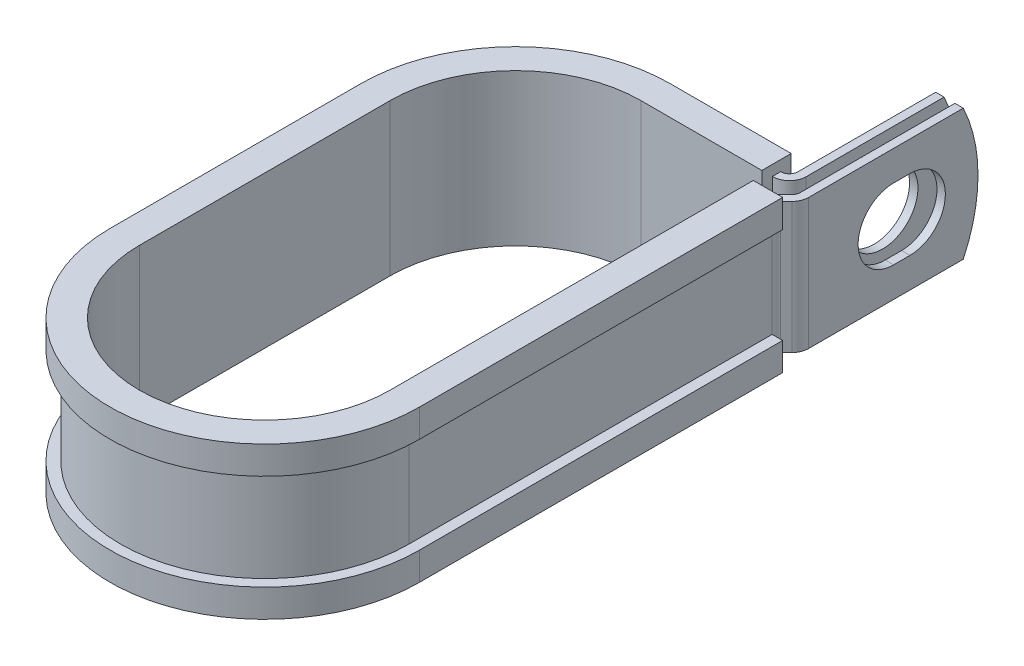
ISO-10303-21;
HEADER;
FILE_DESCRIPTION(('STEP AP214'),'2;1');
FILE_NAME('part.step','',(''),(''),'','','');
FILE_SCHEMA(('AUTOMOTIVE_DESIGN { 1 0 10303 214 1 1 1 1 }'));
ENDSEC;
DATA;
#1=APPLICATION_CONTEXT('core data for automotive mechanical design processes');
#2=APPLICATION_PROTOCOL_DEFINITION('international standard','automotive_design',2000,#1);
#3=PRODUCT_CONTEXT('',#1,'mechanical');
#4=PRODUCT('Part','Part','',(#3));
#5=PRODUCT_RELATED_PRODUCT_CATEGORY('part','',(#4));
#6=PRODUCT_DEFINITION_FORMATION('','',#4);
#7=PRODUCT_DEFINITION_CONTEXT('part definition',#1,'design');
#8=PRODUCT_DEFINITION('design','',#6,#7);
#9=PRODUCT_DEFINITION_SHAPE('','',#8);
#10=(LENGTH_UNIT() NAMED_UNIT(*) SI_UNIT(.MILLI.,.METRE.));
#11=(NAMED_UNIT(*) PLANE_ANGLE_UNIT() SI_UNIT($,.RADIAN.));
#12=(NAMED_UNIT(*) SI_UNIT($,.STERADIAN.) SOLID_ANGLE_UNIT());
#13=UNCERTAINTY_MEASURE_WITH_UNIT(LENGTH_MEASURE(1.E-05),#10,'distance_accuracy_value','');
#14=(GEOMETRIC_REPRESENTATION_CONTEXT(3) GLOBAL_UNCERTAINTY_ASSIGNED_CONTEXT((#13)) GLOBAL_UNIT_ASSIGNED_CONTEXT((#10,
#11,#12)) REPRESENTATION_CONTEXT('',''));
#15=CARTESIAN_POINT('',(0.,0.,0.));
#16=DIRECTION('',(0.,0.,1.));
#17=DIRECTION('',(1.,0.,0.));
#18=AXIS2_PLACEMENT_3D('',#15,#16,#17);
#19=CARTESIAN_POINT('',(20.4521698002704,-9.525,-19.7739));
#20=DIRECTION('',(0.,1.,0.));
#21=DIRECTION('',(1.,0.,0.));
#22=AXIS2_PLACEMENT_3D('',#19,#20,#21);
#23=PLANE('',#22);
#24=DIRECTION('',(0.,0.,-1.));
#25=VECTOR('',#24,1.);
#26=CARTESIAN_POINT('',(17.6073698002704,-9.525,-19.7739));
#27=LINE('',#26,#25);
#28=CARTESIAN_POINT('',(17.6073698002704,-9.525,-19.7739));
#29=VERTEX_POINT('',#28);
#30=CARTESIAN_POINT('',(17.6073698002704,-9.525,-20.9931));
#31=VERTEX_POINT('',#30);
#32=EDGE_CURVE('E582',#29,#31,#27,.T.);
#33=ORIENTED_EDGE('',*,*,#32,.T.);
#34=DIRECTION('',(1.,0.,0.));
#35=VECTOR('',#34,1.);
#36=CARTESIAN_POINT('',(0.,-9.525,-20.9931));
#37=LINE('',#36,#35);
#38=CARTESIAN_POINT('',(17.6581698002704,-9.525,-20.9931));
#39=VERTEX_POINT('',#38);
#40=EDGE_CURVE('E416',#39,#31,#37,.F.);
#41=ORIENTED_EDGE('',*,*,#40,.F.);
#42=CARTESIAN_POINT('',(17.6581698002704,-9.525,-22.2123));
#43=DIRECTION('',(0.,1.,0.));
#44=DIRECTION('',(1.,0.,0.));
#45=AXIS2_PLACEMENT_3D('',#42,#43,#44);
#46=CIRCLE('',#45,1.2192);
#47=CARTESIAN_POINT('',(18.8773698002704,-9.525,-22.2123));
#48=VERTEX_POINT('',#47);
#49=EDGE_CURVE('E414',#48,#39,#46,.F.);
#50=ORIENTED_EDGE('',*,*,#49,.F.);
#51=DIRECTION('',(0.,0.,1.));
#52=VECTOR('',#51,1.);
#53=CARTESIAN_POINT('',(18.8773698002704,-9.525,-44.4246));
#54=LINE('',#53,#52);
#55=CARTESIAN_POINT('',(18.8773698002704,-9.525,-42.2800631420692));
#56=VERTEX_POINT('',#55);
#57=EDGE_CURVE('E412',#56,#48,#54,.T.);
#58=ORIENTED_EDGE('',*,*,#57,.F.);
#59=DIRECTION('',(-1.,0.,0.));
#60=VECTOR('',#59,1.);
#61=CARTESIAN_POINT('',(22.8905698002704,-9.525,-42.2800631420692));
#62=LINE('',#61,#60);
#63=CARTESIAN_POINT('',(20.0965698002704,-9.525,-42.2800631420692));
#64=VERTEX_POINT('',#63);
#65=EDGE_CURVE('E12',#64,#56,#62,.T.);
#66=ORIENTED_EDGE('',*,*,#65,.F.);
#67=DIRECTION('',(0.,0.,1.));
#68=VECTOR('',#67,1.);
#69=CARTESIAN_POINT('',(20.0965698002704,-9.525,-44.4246));
#70=LINE('',#69,#68);
#71=CARTESIAN_POINT('',(20.0965698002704,-9.525,-22.2123));
#72=VERTEX_POINT('',#71);
#73=EDGE_CURVE('E410',#64,#72,#70,.T.);
#74=ORIENTED_EDGE('',*,*,#73,.T.);
#75=CARTESIAN_POINT('',(17.6581698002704,-9.525,-22.2123));
#76=DIRECTION('',(0.,-1.,0.));
#77=DIRECTION('',(0.,0.,1.));
#78=AXIS2_PLACEMENT_3D('',#75,#76,#77);
#79=CIRCLE('',#78,2.4384);
#80=CARTESIAN_POINT('',(17.6581698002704,-9.525,-19.7739));
#81=VERTEX_POINT('',#80);
#82=EDGE_CURVE('E407',#72,#81,#79,.T.);
#83=ORIENTED_EDGE('',*,*,#82,.T.);
#84=DIRECTION('',(-1.,0.,0.));
#85=VECTOR('',#84,1.);
#86=CARTESIAN_POINT('',(0.,-9.525,-19.7739));
#87=LINE('',#86,#85);
#88=EDGE_CURVE('E404',#81,#29,#87,.T.);
#89=ORIENTED_EDGE('',*,*,#88,.T.);
#90=EDGE_LOOP('',(#33,#41,#50,#58,#66,#74,#83,#89));
#91=FACE_BOUND('',#90,.T.);
#92=ADVANCED_FACE('F55',(#91),#23,.F.);
#93=CARTESIAN_POINT('',(20.4521698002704,9.525,-19.7739));
#94=DIRECTION('',(0.,1.,0.));
#95=DIRECTION('',(1.,0.,0.));
#96=AXIS2_PLACEMENT_3D('',#93,#94,#95);
#97=PLANE('',#96);
#98=DIRECTION('',(1.,0.,0.));
#99=VECTOR('',#98,1.);
#100=CARTESIAN_POINT('',(0.,9.525,-20.9931));
#101=LINE('',#100,#99);
#102=CARTESIAN_POINT('',(17.6581698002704,9.525,-20.9931));
#103=VERTEX_POINT('',#102);
#104=CARTESIAN_POINT('',(17.6073698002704,9.525,-20.9931));
#105=VERTEX_POINT('',#104);
#106=EDGE_CURVE('E377',#103,#105,#101,.F.);
#107=ORIENTED_EDGE('',*,*,#106,.T.);
#108=DIRECTION('',(0.,0.,1.));
#109=VECTOR('',#108,1.);
#110=CARTESIAN_POINT('',(17.6073698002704,9.525,-20.9931));
#111=LINE('',#110,#109);
#112=CARTESIAN_POINT('',(17.6073698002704,9.525,-19.7739));
#113=VERTEX_POINT('',#112);
#114=EDGE_CURVE('E588',#105,#113,#111,.T.);
#115=ORIENTED_EDGE('',*,*,#114,.T.);
#116=DIRECTION('',(-1.,0.,0.));
#117=VECTOR('',#116,1.);
#118=CARTESIAN_POINT('',(0.,9.525,-19.7739));
#119=LINE('',#118,#117);
#120=CARTESIAN_POINT('',(17.6581698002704,9.525,-19.7739));
#121=VERTEX_POINT('',#120);
#122=EDGE_CURVE('E479',#121,#113,#119,.T.);
#123=ORIENTED_EDGE('',*,*,#122,.F.);
#124=CARTESIAN_POINT('',(17.6581698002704,9.525,-22.2123));
#125=DIRECTION('',(0.,-1.,0.));
#126=DIRECTION('',(0.,0.,1.));
#127=AXIS2_PLACEMENT_3D('',#124,#125,#126);
#128=CIRCLE('',#127,2.4384);
#129=CARTESIAN_POINT('',(20.0965698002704,9.525,-22.2123));
#130=VERTEX_POINT('',#129);
#131=EDGE_CURVE('E474',#130,#121,#128,.T.);
#132=ORIENTED_EDGE('',*,*,#131,.F.);
#133=DIRECTION('',(0.,0.,1.));
#134=VECTOR('',#133,1.);
#135=CARTESIAN_POINT('',(20.0965698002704,9.525,-44.4246));
#136=LINE('',#135,#134);
#137=CARTESIAN_POINT('',(20.0965698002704,9.525,-42.2800631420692));
#138=VERTEX_POINT('',#137);
#139=EDGE_CURVE('E468',#138,#130,#136,.T.);
#140=ORIENTED_EDGE('',*,*,#139,.F.);
#141=DIRECTION('',(-1.,0.,0.));
#142=VECTOR('',#141,1.);
#143=CARTESIAN_POINT('',(22.8905698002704,9.525,-42.2800631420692));
#144=LINE('',#143,#142);
#145=CARTESIAN_POINT('',(18.8773698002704,9.525,-42.2800631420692));
#146=VERTEX_POINT('',#145);
#147=EDGE_CURVE('E63',#138,#146,#144,.T.);
#148=ORIENTED_EDGE('',*,*,#147,.T.);
#149=DIRECTION('',(0.,0.,1.));
#150=VECTOR('',#149,1.);
#151=CARTESIAN_POINT('',(18.8773698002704,9.525,-44.4246));
#152=LINE('',#151,#150);
#153=CARTESIAN_POINT('',(18.8773698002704,9.525,-22.2123));
#154=VERTEX_POINT('',#153);
#155=EDGE_CURVE('E465',#146,#154,#152,.T.);
#156=ORIENTED_EDGE('',*,*,#155,.T.);
#157=CARTESIAN_POINT('',(17.6581698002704,9.525,-22.2123));
#158=DIRECTION('',(0.,1.,0.));
#159=DIRECTION('',(1.,0.,0.));
#160=AXIS2_PLACEMENT_3D('',#157,#158,#159);
#161=CIRCLE('',#160,1.2192);
#162=EDGE_CURVE('E382',#154,#103,#161,.F.);
#163=ORIENTED_EDGE('',*,*,#162,.T.);
#164=EDGE_LOOP('',(#107,#115,#123,#132,#140,#148,#156,#163));
#165=FACE_BOUND('',#164,.T.);
#166=ADVANCED_FACE('F464',(#165),#97,.T.);
#167=CARTESIAN_POINT('',(0.,9.525,-19.7739));
#168=DIRECTION('',(0.,0.,1.));
#169=DIRECTION('',(1.,0.,0.));
#170=AXIS2_PLACEMENT_3D('',#167,#168,#169);
#171=PLANE('',#170);
#172=ORIENTED_EDGE('',*,*,#122,.T.);
#173=DIRECTION('',(0.,-1.,0.));
#174=VECTOR('',#173,1.);
#175=CARTESIAN_POINT('',(17.6073698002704,9.525,-19.7739));
#176=LINE('',#175,#174);
#177=EDGE_CURVE('E585',#113,#29,#176,.T.);
#178=ORIENTED_EDGE('',*,*,#177,.T.);
#179=ORIENTED_EDGE('',*,*,#88,.F.);
#180=DIRECTION('',(0.,-1.,0.));
#181=VECTOR('',#180,1.);
#182=CARTESIAN_POINT('',(17.6581698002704,9.525,-19.7739));
#183=LINE('',#182,#181);
#184=EDGE_CURVE('E452',#121,#81,#183,.T.);
#185=ORIENTED_EDGE('',*,*,#184,.F.);
#186=EDGE_LOOP('',(#172,#178,#179,#185));
#187=FACE_BOUND('',#186,.T.);
#188=ADVANCED_FACE('F789',(#187),#171,.T.);
#189=CARTESIAN_POINT('',(22.8905698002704,9.525,-19.7739));
#190=DIRECTION('',(-1.,0.,0.));
#191=DIRECTION('',(0.,0.,1.));
#192=AXIS2_PLACEMENT_3D('',#189,#190,#191);
#193=PLANE('',#192);
#194=CARTESIAN_POINT('',(22.8905698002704,0.,-34.5185999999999));
#195=DIRECTION('',(1.,0.,0.));
#196=DIRECTION('',(0.,0.,-1.));
#197=AXIS2_PLACEMENT_3D('',#194,#195,#196);
#198=CIRCLE('',#197,5.1562);
#199=CARTESIAN_POINT('',(22.8905698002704,-5.1562,-34.5186000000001));
#200=VERTEX_POINT('',#199);
#201=CARTESIAN_POINT('',(22.8905698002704,5.1562,-34.5186000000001));
#202=VERTEX_POINT('',#201);
#203=EDGE_CURVE('E527',#200,#202,#198,.T.);
#204=ORIENTED_EDGE('',*,*,#203,.F.);
#205=DIRECTION('',(0.,0.,-1.));
#206=VECTOR('',#205,1.);
#207=CARTESIAN_POINT('',(22.8905698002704,-5.1562,-32.1309999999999));
#208=LINE('',#207,#206);
#209=CARTESIAN_POINT('',(22.8905698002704,-5.1562,-32.1309999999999));
#210=VERTEX_POINT('',#209);
#211=EDGE_CURVE('E524',#210,#200,#208,.T.);
#212=ORIENTED_EDGE('',*,*,#211,.F.);
#213=CARTESIAN_POINT('',(22.8905698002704,0.,-32.1309999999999));
#214=DIRECTION('',(1.,0.,0.));
#215=DIRECTION('',(0.,0.,-1.));
#216=AXIS2_PLACEMENT_3D('',#213,#214,#215);
#217=CIRCLE('',#216,5.1562);
#218=CARTESIAN_POINT('',(22.8905698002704,5.1562,-32.1309999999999));
#219=VERTEX_POINT('',#218);
#220=EDGE_CURVE('E521',#219,#210,#217,.T.);
#221=ORIENTED_EDGE('',*,*,#220,.F.);
#222=DIRECTION('',(0.,0.,1.));
#223=VECTOR('',#222,1.);
#224=CARTESIAN_POINT('',(22.8905698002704,5.1562,-32.1309999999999));
#225=LINE('',#224,#223);
#226=EDGE_CURVE('E520',#202,#219,#225,.T.);
#227=ORIENTED_EDGE('',*,*,#226,.F.);
#228=EDGE_LOOP('',(#204,#212,#221,#227));
#229=FACE_BOUND('',#228,.T.);
#230=DIRECTION('',(0.,0.,-1.));
#231=VECTOR('',#230,1.);
#232=CARTESIAN_POINT('',(22.8905698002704,-9.525,-19.7739));
#233=LINE('',#232,#231);
#234=CARTESIAN_POINT('',(22.8905698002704,-9.525,-19.7739));
#235=VERTEX_POINT('',#234);
#236=CARTESIAN_POINT('',(22.8905698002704,-9.525,-42.2800631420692));
#237=VERTEX_POINT('',#236);
#238=EDGE_CURVE('E388',#235,#237,#233,.T.);
#239=ORIENTED_EDGE('',*,*,#238,.T.);
#240=CARTESIAN_POINT('',(22.8905698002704,0.,-22.1996));
#241=DIRECTION('',(-1.,0.,0.));
#242=DIRECTION('',(0.,0.,1.));
#243=AXIS2_PLACEMENT_3D('',#240,#241,#242);
#244=CIRCLE('',#243,22.225);
#245=CARTESIAN_POINT('',(22.8905698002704,9.525,-42.2800631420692));
#246=VERTEX_POINT('',#245);
#247=EDGE_CURVE('E536',#246,#237,#244,.T.);
#248=ORIENTED_EDGE('',*,*,#247,.F.);
#249=DIRECTION('',(0.,0.,-1.));
#250=VECTOR('',#249,1.);
#251=CARTESIAN_POINT('',(22.8905698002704,9.525,-19.7739));
#252=LINE('',#251,#250);
#253=CARTESIAN_POINT('',(22.8905698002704,9.525,-19.7739));
#254=VERTEX_POINT('',#253);
#255=EDGE_CURVE('E425',#254,#246,#252,.T.);
#256=ORIENTED_EDGE('',*,*,#255,.F.);
#257=DIRECTION('',(0.,-1.,0.));
#258=VECTOR('',#257,1.);
#259=CARTESIAN_POINT('',(22.8905698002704,9.525,-19.7739));
#260=LINE('',#259,#258);
#261=EDGE_CURVE('E387',#254,#235,#260,.T.);
#262=ORIENTED_EDGE('',*,*,#261,.T.);
#263=EDGE_LOOP('',(#239,#248,#256,#262));
#264=FACE_BOUND('',#263,.T.);
#265=ADVANCED_FACE('F57',(#229,#264),#193,.F.);
#266=CARTESIAN_POINT('',(21.6713698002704,9.525,-19.7739));
#267=DIRECTION('',(-1.,0.,0.));
#268=DIRECTION('',(0.,0.,1.));
#269=AXIS2_PLACEMENT_3D('',#266,#267,#268);
#270=PLANE('',#269);
#271=DIRECTION('',(0.,0.,-1.));
#272=VECTOR('',#271,1.);
#273=CARTESIAN_POINT('',(21.6713698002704,-5.1562,-32.1309999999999));
#274=LINE('',#273,#272);
#275=CARTESIAN_POINT('',(21.6713698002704,-5.1562,-32.1309999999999));
#276=VERTEX_POINT('',#275);
#277=CARTESIAN_POINT('',(21.6713698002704,-5.1562,-34.5186000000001));
#278=VERTEX_POINT('',#277);
#279=EDGE_CURVE('E505',#276,#278,#274,.T.);
#280=ORIENTED_EDGE('',*,*,#279,.T.);
#281=CARTESIAN_POINT('',(21.6713698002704,0.,-34.5185999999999));
#282=DIRECTION('',(-1.,0.,0.));
#283=DIRECTION('',(0.,0.,1.));
#284=AXIS2_PLACEMENT_3D('',#281,#282,#283);
#285=CIRCLE('',#284,5.1562);
#286=CARTESIAN_POINT('',(21.6713698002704,5.1562,-34.5186000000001));
#287=VERTEX_POINT('',#286);
#288=EDGE_CURVE('E504',#278,#287,#285,.F.);
#289=ORIENTED_EDGE('',*,*,#288,.T.);
#290=DIRECTION('',(0.,0.,1.));
#291=VECTOR('',#290,1.);
#292=CARTESIAN_POINT('',(21.6713698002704,5.1562,-32.1309999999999));
#293=LINE('',#292,#291);
#294=CARTESIAN_POINT('',(21.6713698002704,5.1562,-32.1309999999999));
#295=VERTEX_POINT('',#294);
#296=EDGE_CURVE('E508',#287,#295,#293,.T.);
#297=ORIENTED_EDGE('',*,*,#296,.T.);
#298=CARTESIAN_POINT('',(21.6713698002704,0.,-32.1309999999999));
#299=DIRECTION('',(-1.,0.,0.));
#300=DIRECTION('',(0.,0.,1.));
#301=AXIS2_PLACEMENT_3D('',#298,#299,#300);
#302=CIRCLE('',#301,5.1562);
#303=EDGE_CURVE('E501',#295,#276,#302,.F.);
#304=ORIENTED_EDGE('',*,*,#303,.T.);
#305=EDGE_LOOP('',(#280,#289,#297,#304));
#306=FACE_BOUND('',#305,.T.);
#307=CARTESIAN_POINT('',(21.6713698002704,0.,-22.1996));
#308=DIRECTION('',(-1.,0.,0.));
#309=DIRECTION('',(0.,0.,1.));
#310=AXIS2_PLACEMENT_3D('',#307,#308,#309);
#311=CIRCLE('',#310,22.225);
#312=CARTESIAN_POINT('',(21.6713698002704,9.525,-42.2800631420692));
#313=VERTEX_POINT('',#312);
#314=CARTESIAN_POINT('',(21.6713698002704,-9.525,-42.2800631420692));
#315=VERTEX_POINT('',#314);
#316=EDGE_CURVE('E77',#313,#315,#311,.T.);
#317=ORIENTED_EDGE('',*,*,#316,.T.);
#318=DIRECTION('',(0.,0.,-1.));
#319=VECTOR('',#318,1.);
#320=CARTESIAN_POINT('',(21.6713698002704,-9.525,-19.7739));
#321=LINE('',#320,#319);
#322=CARTESIAN_POINT('',(21.6713698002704,-9.525,-19.7739));
#323=VERTEX_POINT('',#322);
#324=EDGE_CURVE('E391',#323,#315,#321,.T.);
#325=ORIENTED_EDGE('',*,*,#324,.F.);
#326=DIRECTION('',(0.,-1.,0.));
#327=VECTOR('',#326,1.);
#328=CARTESIAN_POINT('',(21.6713698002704,9.525,-19.7739));
#329=LINE('',#328,#327);
#330=CARTESIAN_POINT('',(21.6713698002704,9.525,-19.7739));
#331=VERTEX_POINT('',#330);
#332=EDGE_CURVE('E460',#331,#323,#329,.T.);
#333=ORIENTED_EDGE('',*,*,#332,.F.);
#334=DIRECTION('',(0.,0.,-1.));
#335=VECTOR('',#334,1.);
#336=CARTESIAN_POINT('',(21.6713698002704,9.525,-19.7739));
#337=LINE('',#336,#335);
#338=EDGE_CURVE('E489',#331,#313,#337,.T.);
#339=ORIENTED_EDGE('',*,*,#338,.T.);
#340=EDGE_LOOP('',(#317,#325,#333,#339));
#341=FACE_BOUND('',#340,.T.);
#342=ADVANCED_FACE('F762',(#306,#341),#270,.T.);
#343=CARTESIAN_POINT('',(20.0965698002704,9.525,-44.4246));
#344=DIRECTION('',(1.,0.,0.));
#345=DIRECTION('',(0.,0.,-1.));
#346=AXIS2_PLACEMENT_3D('',#343,#344,#345);
#347=PLANE('',#346);
#348=CARTESIAN_POINT('',(20.0965698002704,0.,-33.3248));
#349=DIRECTION('',(1.,0.,0.));
#350=DIRECTION('',(0.,0.,-1.));
#351=AXIS2_PLACEMENT_3D('',#348,#349,#350);
#352=CIRCLE('',#351,5.1562);
#353=CARTESIAN_POINT('',(20.0965698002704,0.,-38.481));
#354=VERTEX_POINT('',#353);
#355=EDGE_CURVE('E392',#354,#354,#352,.F.);
#356=ORIENTED_EDGE('',*,*,#355,.T.);
#357=EDGE_LOOP('',(#356));
#358=FACE_BOUND('',#357,.T.);
#359=ORIENTED_EDGE('',*,*,#73,.F.);
#360=CARTESIAN_POINT('',(20.0965698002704,0.,-22.1996));
#361=DIRECTION('',(1.,0.,0.));
#362=DIRECTION('',(0.,0.,-1.));
#363=AXIS2_PLACEMENT_3D('',#360,#361,#362);
#364=CIRCLE('',#363,22.225);
#365=EDGE_CURVE('E532',#64,#138,#364,.T.);
#366=ORIENTED_EDGE('',*,*,#365,.T.);
#367=ORIENTED_EDGE('',*,*,#139,.T.);
#368=DIRECTION('',(0.,-1.,0.));
#369=VECTOR('',#368,1.);
#370=CARTESIAN_POINT('',(20.0965698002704,9.525,-22.2123));
#371=LINE('',#370,#369);
#372=EDGE_CURVE('E449',#130,#72,#371,.T.);
#373=ORIENTED_EDGE('',*,*,#372,.T.);
#374=EDGE_LOOP('',(#359,#366,#367,#373));
#375=FACE_BOUND('',#374,.T.);
#376=ADVANCED_FACE('F797',(#358,#375),#347,.T.);
#377=CARTESIAN_POINT('',(18.8773698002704,9.525,-44.4246));
#378=DIRECTION('',(1.,0.,0.));
#379=DIRECTION('',(0.,0.,-1.));
#380=AXIS2_PLACEMENT_3D('',#377,#378,#379);
#381=PLANE('',#380);
#382=CARTESIAN_POINT('',(18.8773698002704,0.,-33.3248));
#383=DIRECTION('',(-1.,0.,0.));
#384=DIRECTION('',(0.,0.,1.));
#385=AXIS2_PLACEMENT_3D('',#382,#383,#384);
#386=CIRCLE('',#385,5.1562);
#387=CARTESIAN_POINT('',(18.8773698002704,0.,-28.1686));
#388=VERTEX_POINT('',#387);
#389=EDGE_CURVE('E496',#388,#388,#386,.T.);
#390=ORIENTED_EDGE('',*,*,#389,.F.);
#391=EDGE_LOOP('',(#390));
#392=FACE_BOUND('',#391,.T.);
#393=CARTESIAN_POINT('',(18.8773698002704,0.,-22.1996));
#394=DIRECTION('',(-1.,0.,0.));
#395=DIRECTION('',(0.,0.,1.));
#396=AXIS2_PLACEMENT_3D('',#393,#394,#395);
#397=CIRCLE('',#396,22.225);
#398=EDGE_CURVE('E69',#146,#56,#397,.T.);
#399=ORIENTED_EDGE('',*,*,#398,.T.);
#400=ORIENTED_EDGE('',*,*,#57,.T.);
#401=DIRECTION('',(0.,-1.,0.));
#402=VECTOR('',#401,1.);
#403=CARTESIAN_POINT('',(18.8773698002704,9.525,-22.2123));
#404=LINE('',#403,#402);
#405=EDGE_CURVE('E446',#154,#48,#404,.T.);
#406=ORIENTED_EDGE('',*,*,#405,.F.);
#407=ORIENTED_EDGE('',*,*,#155,.F.);
#408=EDGE_LOOP('',(#399,#400,#406,#407));
#409=FACE_BOUND('',#408,.T.);
#410=ADVANCED_FACE('F471',(#392,#409),#381,.F.);
#411=CARTESIAN_POINT('',(22.2123,-9.525,-16.3614026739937));
#412=DIRECTION('',(0.,1.,0.));
#413=DIRECTION('',(1.,0.,0.));
#414=AXIS2_PLACEMENT_3D('',#411,#412,#413);
#415=CIRCLE('',#414,1.2192);
#416=CARTESIAN_POINT('',(20.9931,-9.525,-16.3614026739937));
#417=VERTEX_POINT('',#416);
#418=CARTESIAN_POINT('',(21.3501954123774,-9.525,-17.2235072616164));
#419=VERTEX_POINT('',#418);
#420=EDGE_CURVE('E419',#417,#419,#415,.F.);
#421=ORIENTED_EDGE('',*,*,#420,.F.);
#422=DIRECTION('',(1.,0.,0.));
#423=VECTOR('',#422,1.);
#424=CARTESIAN_POINT('',(19.7739,-9.525,-16.3614026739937));
#425=LINE('',#424,#423);
#426=CARTESIAN_POINT('',(19.7739,-9.525,-16.3614026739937));
#427=VERTEX_POINT('',#426);
#428=EDGE_CURVE('E370',#427,#417,#425,.T.);
#429=ORIENTED_EDGE('',*,*,#428,.F.);
#430=CARTESIAN_POINT('',(22.2123,-9.525,-16.3614026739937));
#431=DIRECTION('',(0.,-1.,0.));
#432=DIRECTION('',(0.,0.,1.));
#433=AXIS2_PLACEMENT_3D('',#430,#431,#432);
#434=CIRCLE('',#433,2.4384);
#435=CARTESIAN_POINT('',(20.4880908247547,-9.525,-18.085611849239));
#436=VERTEX_POINT('',#435);
#437=EDGE_CURVE('E401',#427,#436,#434,.T.);
#438=ORIENTED_EDGE('',*,*,#437,.T.);
#439=DIRECTION('',(0.707106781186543,0.,-0.707106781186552));
#440=VECTOR('',#439,1.);
#441=CARTESIAN_POINT('',(20.4880908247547,-9.525,-18.085611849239));
#442=LINE('',#441,#440);
#443=CARTESIAN_POINT('',(21.3142743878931,-9.525,-18.9117954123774));
#444=VERTEX_POINT('',#443);
#445=EDGE_CURVE('E398',#436,#444,#442,.T.);
#446=ORIENTED_EDGE('',*,*,#445,.T.);
#447=CARTESIAN_POINT('',(20.4521698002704,-9.525,-19.7739));
#448=DIRECTION('',(0.,1.,0.));
#449=DIRECTION('',(0.,0.,1.));
#450=AXIS2_PLACEMENT_3D('',#447,#448,#449);
#451=CIRCLE('',#450,1.2192);
#452=EDGE_CURVE('E395',#444,#323,#451,.T.);
#453=ORIENTED_EDGE('',*,*,#452,.T.);
#454=ORIENTED_EDGE('',*,*,#324,.T.);
#455=DIRECTION('',(-1.,0.,0.));
#456=VECTOR('',#455,1.);
#457=CARTESIAN_POINT('',(22.8905698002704,-9.525,-42.2800631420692));
#458=LINE('',#457,#456);
#459=EDGE_CURVE('E538',#237,#315,#458,.T.);
#460=ORIENTED_EDGE('',*,*,#459,.F.);
#461=ORIENTED_EDGE('',*,*,#238,.F.);
#462=CARTESIAN_POINT('',(20.4521698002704,-9.525,-19.7739));
#463=DIRECTION('',(0.,1.,0.));
#464=DIRECTION('',(1.,0.,0.));
#465=AXIS2_PLACEMENT_3D('',#462,#463,#464);
#466=CIRCLE('',#465,2.4384);
#467=CARTESIAN_POINT('',(22.1763789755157,-9.525,-18.0496908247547));
#468=VERTEX_POINT('',#467);
#469=EDGE_CURVE('E423',#468,#235,#466,.T.);
#470=ORIENTED_EDGE('',*,*,#469,.F.);
#471=DIRECTION('',(0.707106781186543,0.,-0.707106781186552));
#472=VECTOR('',#471,1.);
#473=CARTESIAN_POINT('',(21.3501954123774,-9.525,-17.2235072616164));
#474=LINE('',#473,#472);
#475=EDGE_CURVE('E421',#419,#468,#474,.T.);
#476=ORIENTED_EDGE('',*,*,#475,.F.);
#477=EDGE_LOOP('',(#421,#429,#438,#446,#453,#454,#460,#461,#470,#476));
#478=FACE_BOUND('',#477,.T.);
#479=ADVANCED_FACE('F743',(#478),#23,.F.);
#480=DIRECTION('',(-1.,0.,0.));
#481=VECTOR('',#480,1.);
#482=CARTESIAN_POINT('',(20.9931,9.525,-16.3614026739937));
#483=LINE('',#482,#481);
#484=CARTESIAN_POINT('',(20.9931,9.525,-16.3614026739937));
#485=VERTEX_POINT('',#484);
#486=CARTESIAN_POINT('',(19.7739,9.525,-16.3614026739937));
#487=VERTEX_POINT('',#486);
#488=EDGE_CURVE('E350',#485,#487,#483,.T.);
#489=ORIENTED_EDGE('',*,*,#488,.F.);
#490=CARTESIAN_POINT('',(22.2123,9.525,-16.3614026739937));
#491=DIRECTION('',(0.,1.,0.));
#492=DIRECTION('',(1.,0.,0.));
#493=AXIS2_PLACEMENT_3D('',#490,#491,#492);
#494=CIRCLE('',#493,1.2192);
#495=CARTESIAN_POINT('',(21.3501954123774,9.525,-17.2235072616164));
#496=VERTEX_POINT('',#495);
#497=EDGE_CURVE('E365',#485,#496,#494,.F.);
#498=ORIENTED_EDGE('',*,*,#497,.T.);
#499=DIRECTION('',(0.707106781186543,0.,-0.707106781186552));
#500=VECTOR('',#499,1.);
#501=CARTESIAN_POINT('',(21.3501954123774,9.525,-17.2235072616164));
#502=LINE('',#501,#500);
#503=CARTESIAN_POINT('',(22.1763789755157,9.525,-18.0496908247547));
#504=VERTEX_POINT('',#503);
#505=EDGE_CURVE('E376',#496,#504,#502,.T.);
#506=ORIENTED_EDGE('',*,*,#505,.T.);
#507=CARTESIAN_POINT('',(20.4521698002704,9.525,-19.7739));
#508=DIRECTION('',(0.,1.,0.));
#509=DIRECTION('',(1.,0.,0.));
#510=AXIS2_PLACEMENT_3D('',#507,#508,#509);
#511=CIRCLE('',#510,2.4384);
#512=EDGE_CURVE('E379',#504,#254,#511,.T.);
#513=ORIENTED_EDGE('',*,*,#512,.T.);
#514=ORIENTED_EDGE('',*,*,#255,.T.);
#515=DIRECTION('',(-1.,0.,0.));
#516=VECTOR('',#515,1.);
#517=CARTESIAN_POINT('',(22.8905698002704,9.525,-42.2800631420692));
#518=LINE('',#517,#516);
#519=EDGE_CURVE('E534',#246,#313,#518,.T.);
#520=ORIENTED_EDGE('',*,*,#519,.T.);
#521=ORIENTED_EDGE('',*,*,#338,.F.);
#522=CARTESIAN_POINT('',(20.4521698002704,9.525,-19.7739));
#523=DIRECTION('',(0.,1.,0.));
#524=DIRECTION('',(0.,0.,1.));
#525=AXIS2_PLACEMENT_3D('',#522,#523,#524);
#526=CIRCLE('',#525,1.2192);
#527=CARTESIAN_POINT('',(21.3142743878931,9.525,-18.9117954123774));
#528=VERTEX_POINT('',#527);
#529=EDGE_CURVE('E486',#528,#331,#526,.T.);
#530=ORIENTED_EDGE('',*,*,#529,.F.);
#531=DIRECTION('',(0.707106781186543,0.,-0.707106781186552));
#532=VECTOR('',#531,1.);
#533=CARTESIAN_POINT('',(20.4880908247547,9.525,-18.085611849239));
#534=LINE('',#533,#532);
#535=CARTESIAN_POINT('',(20.4880908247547,9.525,-18.085611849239));
#536=VERTEX_POINT('',#535);
#537=EDGE_CURVE('E483',#536,#528,#534,.T.);
#538=ORIENTED_EDGE('',*,*,#537,.F.);
#539=CARTESIAN_POINT('',(22.2123,9.525,-16.3614026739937));
#540=DIRECTION('',(0.,-1.,0.));
#541=DIRECTION('',(0.,0.,1.));
#542=AXIS2_PLACEMENT_3D('',#539,#540,#541);
#543=CIRCLE('',#542,2.4384);
#544=EDGE_CURVE('E369',#487,#536,#543,.T.);
#545=ORIENTED_EDGE('',*,*,#544,.F.);
#546=EDGE_LOOP('',(#489,#498,#506,#513,#514,#520,#521,#530,#538,#545));
#547=FACE_BOUND('',#546,.T.);
#548=ADVANCED_FACE('F364',(#547),#97,.T.);
#549=CARTESIAN_POINT('',(20.4521698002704,9.525,-19.7739));
#550=DIRECTION('',(0.,-1.,0.));
#551=DIRECTION('',(0.,0.,-1.));
#552=AXIS2_PLACEMENT_3D('',#549,#550,#551);
#553=CYLINDRICAL_SURFACE('',#552,1.2192);
#554=ORIENTED_EDGE('',*,*,#452,.F.);
#555=DIRECTION('',(0.,-1.,0.));
#556=VECTOR('',#555,1.);
#557=CARTESIAN_POINT('',(21.3142743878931,9.525,-18.9117954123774));
#558=LINE('',#557,#556);
#559=EDGE_CURVE('E458',#528,#444,#558,.T.);
#560=ORIENTED_EDGE('',*,*,#559,.F.);
#561=ORIENTED_EDGE('',*,*,#529,.T.);
#562=ORIENTED_EDGE('',*,*,#332,.T.);
#563=EDGE_LOOP('',(#554,#560,#561,#562));
#564=FACE_BOUND('',#563,.T.);
#565=ADVANCED_FACE('F765',(#564),#553,.F.);
#566=CARTESIAN_POINT('',(20.4880908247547,9.525,-18.085611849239));
#567=DIRECTION('',(-0.707106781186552,0.,-0.707106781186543));
#568=DIRECTION('',(-0.707106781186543,0.,0.707106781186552));
#569=AXIS2_PLACEMENT_3D('',#566,#567,#568);
#570=PLANE('',#569);
#571=ORIENTED_EDGE('',*,*,#445,.F.);
#572=DIRECTION('',(0.,-1.,0.));
#573=VECTOR('',#572,1.);
#574=CARTESIAN_POINT('',(20.4880908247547,9.525,-18.085611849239));
#575=LINE('',#574,#573);
#576=EDGE_CURVE('E456',#536,#436,#575,.T.);
#577=ORIENTED_EDGE('',*,*,#576,.F.);
#578=ORIENTED_EDGE('',*,*,#537,.T.);
#579=ORIENTED_EDGE('',*,*,#559,.T.);
#580=EDGE_LOOP('',(#571,#577,#578,#579));
#581=FACE_BOUND('',#580,.T.);
#582=ADVANCED_FACE('F768',(#581),#570,.T.);
#583=CARTESIAN_POINT('',(22.2123,9.525,-16.3614026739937));
#584=DIRECTION('',(0.,-1.,0.));
#585=DIRECTION('',(0.,0.,-1.));
#586=AXIS2_PLACEMENT_3D('',#583,#584,#585);
#587=CYLINDRICAL_SURFACE('',#586,2.4384);
#588=ORIENTED_EDGE('',*,*,#437,.F.);
#589=DIRECTION('',(0.,-1.,0.));
#590=VECTOR('',#589,1.);
#591=CARTESIAN_POINT('',(19.7739,9.525,-16.3614026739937));
#592=LINE('',#591,#590);
#593=EDGE_CURVE('E454',#487,#427,#592,.T.);
#594=ORIENTED_EDGE('',*,*,#593,.F.);
#595=ORIENTED_EDGE('',*,*,#544,.T.);
#596=ORIENTED_EDGE('',*,*,#576,.T.);
#597=EDGE_LOOP('',(#588,#594,#595,#596));
#598=FACE_BOUND('',#597,.T.);
#599=ADVANCED_FACE('F770',(#598),#587,.T.);
#600=CARTESIAN_POINT('',(17.6581698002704,9.525,-22.2123));
#601=DIRECTION('',(0.,-1.,0.));
#602=DIRECTION('',(0.,0.,-1.));
#603=AXIS2_PLACEMENT_3D('',#600,#601,#602);
#604=CYLINDRICAL_SURFACE('',#603,2.4384);
#605=ORIENTED_EDGE('',*,*,#82,.F.);
#606=ORIENTED_EDGE('',*,*,#372,.F.);
#607=ORIENTED_EDGE('',*,*,#131,.T.);
#608=ORIENTED_EDGE('',*,*,#184,.T.);
#609=EDGE_LOOP('',(#605,#606,#607,#608));
#610=FACE_BOUND('',#609,.T.);
#611=ADVANCED_FACE('F772',(#610),#604,.T.);
#612=CARTESIAN_POINT('',(17.6581698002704,9.525,-22.2123));
#613=DIRECTION('',(0.,-1.,0.));
#614=DIRECTION('',(0.,0.,-1.));
#615=AXIS2_PLACEMENT_3D('',#612,#613,#614);
#616=CYLINDRICAL_SURFACE('',#615,1.2192);
#617=ORIENTED_EDGE('',*,*,#49,.T.);
#618=DIRECTION('',(0.,-1.,0.));
#619=VECTOR('',#618,1.);
#620=CARTESIAN_POINT('',(17.6581698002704,9.525,-20.9931));
#621=LINE('',#620,#619);
#622=EDGE_CURVE('E443',#103,#39,#621,.T.);
#623=ORIENTED_EDGE('',*,*,#622,.F.);
#624=ORIENTED_EDGE('',*,*,#162,.F.);
#625=ORIENTED_EDGE('',*,*,#405,.T.);
#626=EDGE_LOOP('',(#617,#623,#624,#625));
#627=FACE_BOUND('',#626,.T.);
#628=ADVANCED_FACE('F778',(#627),#616,.F.);
#629=CARTESIAN_POINT('',(0.,9.525,-20.9931));
#630=DIRECTION('',(0.,0.,1.));
#631=DIRECTION('',(1.,0.,0.));
#632=AXIS2_PLACEMENT_3D('',#629,#630,#631);
#633=PLANE('',#632);
#634=DIRECTION('',(0.,-1.,0.));
#635=VECTOR('',#634,1.);
#636=CARTESIAN_POINT('',(0.,9.525,-20.9931));
#637=LINE('',#636,#635);
#638=CARTESIAN_POINT('',(0.,6.985,-20.9931));
#639=VERTEX_POINT('',#638);
#640=CARTESIAN_POINT('',(0.,-6.985,-20.9931));
#641=VERTEX_POINT('',#640);
#642=EDGE_CURVE('E440',#639,#641,#637,.T.);
#643=ORIENTED_EDGE('',*,*,#642,.F.);
#644=DIRECTION('',(1.,0.,0.));
#645=VECTOR('',#644,1.);
#646=CARTESIAN_POINT('',(0.,6.985,-20.9931));
#647=LINE('',#646,#645);
#648=CARTESIAN_POINT('',(17.6073698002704,6.985,-20.9931));
#649=VERTEX_POINT('',#648);
#650=EDGE_CURVE('E541',#639,#649,#647,.T.);
#651=ORIENTED_EDGE('',*,*,#650,.T.);
#652=DIRECTION('',(0.,1.,0.));
#653=VECTOR('',#652,1.);
#654=CARTESIAN_POINT('',(17.6073698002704,9.525,-20.9931));
#655=LINE('',#654,#653);
#656=EDGE_CURVE('E591',#649,#105,#655,.T.);
#657=ORIENTED_EDGE('',*,*,#656,.T.);
#658=ORIENTED_EDGE('',*,*,#106,.F.);
#659=ORIENTED_EDGE('',*,*,#622,.T.);
#660=ORIENTED_EDGE('',*,*,#40,.T.);
#661=DIRECTION('',(0.,1.,0.));
#662=VECTOR('',#661,1.);
#663=CARTESIAN_POINT('',(17.6073698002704,-9.525,-20.9931));
#664=LINE('',#663,#662);
#665=CARTESIAN_POINT('',(17.6073698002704,-6.985,-20.9931));
#666=VERTEX_POINT('',#665);
#667=EDGE_CURVE('E579',#31,#666,#664,.T.);
#668=ORIENTED_EDGE('',*,*,#667,.T.);
#669=DIRECTION('',(1.,0.,0.));
#670=VECTOR('',#669,1.);
#671=CARTESIAN_POINT('',(0.,-6.985,-20.9931));
#672=LINE('',#671,#670);
#673=EDGE_CURVE('E562',#641,#666,#672,.T.);
#674=ORIENTED_EDGE('',*,*,#673,.F.);
#675=EDGE_LOOP('',(#643,#651,#657,#658,#659,#660,#668,#674));
#676=FACE_BOUND('',#675,.T.);
#677=ADVANCED_FACE('F830',(#676),#633,.F.);
#678=CARTESIAN_POINT('',(0.,9.525,0.));
#679=DIRECTION('',(0.,-1.,0.));
#680=DIRECTION('',(0.,0.,-1.));
#681=AXIS2_PLACEMENT_3D('',#678,#679,#680);
#682=CYLINDRICAL_SURFACE('',#681,20.9931);
#683=DIRECTION('',(0.,-1.,0.));
#684=VECTOR('',#683,1.);
#685=CARTESIAN_POINT('',(-20.9931,9.525,0.));
#686=LINE('',#685,#684);
#687=CARTESIAN_POINT('',(-20.9931,6.985,0.));
#688=VERTEX_POINT('',#687);
#689=CARTESIAN_POINT('',(-20.9931,-6.985,0.));
#690=VERTEX_POINT('',#689);
#691=EDGE_CURVE('E437',#688,#690,#686,.T.);
#692=ORIENTED_EDGE('',*,*,#691,.F.);
#693=CARTESIAN_POINT('',(0.,6.985,0.));
#694=DIRECTION('',(0.,-1.,0.));
#695=DIRECTION('',(0.,0.,-1.));
#696=AXIS2_PLACEMENT_3D('',#693,#694,#695);
#697=CIRCLE('',#696,20.9931);
#698=EDGE_CURVE('E594',#688,#639,#697,.T.);
#699=ORIENTED_EDGE('',*,*,#698,.T.);
#700=ORIENTED_EDGE('',*,*,#642,.T.);
#701=CARTESIAN_POINT('',(0.,-6.985,0.));
#702=DIRECTION('',(0.,-1.,0.));
#703=DIRECTION('',(0.,0.,-1.));
#704=AXIS2_PLACEMENT_3D('',#701,#702,#703);
#705=CIRCLE('',#704,20.9931);
#706=EDGE_CURVE('E615',#690,#641,#705,.T.);
#707=ORIENTED_EDGE('',*,*,#706,.F.);
#708=EDGE_LOOP('',(#692,#699,#700,#707));
#709=FACE_BOUND('',#708,.T.);
#710=ADVANCED_FACE('F841',(#709),#682,.T.);
#711=CARTESIAN_POINT('',(-20.9931,9.525,0.));
#712=DIRECTION('',(1.,0.,0.));
#713=DIRECTION('',(0.,0.,-1.));
#714=AXIS2_PLACEMENT_3D('',#711,#712,#713);
#715=PLANE('',#714);
#716=DIRECTION('',(0.,-1.,0.));
#717=VECTOR('',#716,1.);
#718=CARTESIAN_POINT('',(-20.9931,9.525,36.4998));
#719=LINE('',#718,#717);
#720=CARTESIAN_POINT('',(-20.9931,6.985,36.4998));
#721=VERTEX_POINT('',#720);
#722=CARTESIAN_POINT('',(-20.9931,-6.985,36.4998));
#723=VERTEX_POINT('',#722);
#724=EDGE_CURVE('E434',#721,#723,#719,.T.);
#725=ORIENTED_EDGE('',*,*,#724,.F.);
#726=DIRECTION('',(0.,0.,-1.));
#727=VECTOR('',#726,1.);
#728=CARTESIAN_POINT('',(-20.9931,6.985,36.4998));
#729=LINE('',#728,#727);
#730=EDGE_CURVE('E626',#721,#688,#729,.T.);
#731=ORIENTED_EDGE('',*,*,#730,.T.);
#732=ORIENTED_EDGE('',*,*,#691,.T.);
#733=DIRECTION('',(0.,0.,-1.));
#734=VECTOR('',#733,1.);
#735=CARTESIAN_POINT('',(-20.9931,-6.985,36.4998));
#736=LINE('',#735,#734);
#737=EDGE_CURVE('E647',#723,#690,#736,.T.);
#738=ORIENTED_EDGE('',*,*,#737,.F.);
#739=EDGE_LOOP('',(#725,#731,#732,#738));
#740=FACE_BOUND('',#739,.T.);
#741=ADVANCED_FACE('F846',(#740),#715,.F.);
#742=CARTESIAN_POINT('',(0.,9.525,36.4998));
#743=DIRECTION('',(0.,-1.,0.));
#744=DIRECTION('',(0.,0.,-1.));
#745=AXIS2_PLACEMENT_3D('',#742,#743,#744);
#746=CYLINDRICAL_SURFACE('',#745,20.9931);
#747=DIRECTION('',(0.,-1.,0.));
#748=VECTOR('',#747,1.);
#749=CARTESIAN_POINT('',(20.9931,9.525,36.4998));
#750=LINE('',#749,#748);
#751=CARTESIAN_POINT('',(20.9931,6.985,36.4998));
#752=VERTEX_POINT('',#751);
#753=CARTESIAN_POINT('',(20.9931,-6.985,36.4998));
#754=VERTEX_POINT('',#753);
#755=EDGE_CURVE('E359',#752,#754,#750,.T.);
#756=ORIENTED_EDGE('',*,*,#755,.F.);
#757=CARTESIAN_POINT('',(0.,6.985,36.4998));
#758=DIRECTION('',(0.,-1.,0.));
#759=DIRECTION('',(0.,0.,-1.));
#760=AXIS2_PLACEMENT_3D('',#757,#758,#759);
#761=CIRCLE('',#760,20.9931);
#762=EDGE_CURVE('E658',#752,#721,#761,.T.);
#763=ORIENTED_EDGE('',*,*,#762,.T.);
#764=ORIENTED_EDGE('',*,*,#724,.T.);
#765=CARTESIAN_POINT('',(0.,-6.985,36.4998));
#766=DIRECTION('',(0.,-1.,0.));
#767=DIRECTION('',(0.,0.,-1.));
#768=AXIS2_PLACEMENT_3D('',#765,#766,#767);
#769=CIRCLE('',#768,20.9931);
#770=EDGE_CURVE('E679',#754,#723,#769,.T.);
#771=ORIENTED_EDGE('',*,*,#770,.F.);
#772=EDGE_LOOP('',(#756,#763,#764,#771));
#773=FACE_BOUND('',#772,.T.);
#774=ADVANCED_FACE('F851',(#773),#746,.T.);
#775=CARTESIAN_POINT('',(20.9931,9.525,0.));
#776=DIRECTION('',(-1.,0.,0.));
#777=DIRECTION('',(0.,0.,1.));
#778=AXIS2_PLACEMENT_3D('',#775,#776,#777);
#779=PLANE('',#778);
#780=DIRECTION('',(0.,-1.,0.));
#781=VECTOR('',#780,1.);
#782=CARTESIAN_POINT('',(20.9931,9.525,-16.3614026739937));
#783=LINE('',#782,#781);
#784=CARTESIAN_POINT('',(20.9931,6.985,-16.3614026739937));
#785=VERTEX_POINT('',#784);
#786=CARTESIAN_POINT('',(20.9931,-6.985,-16.3614026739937));
#787=VERTEX_POINT('',#786);
#788=EDGE_CURVE('E360',#785,#787,#783,.T.);
#789=ORIENTED_EDGE('',*,*,#788,.F.);
#790=DIRECTION('',(0.,0.,-1.));
#791=VECTOR('',#790,1.);
#792=CARTESIAN_POINT('',(20.9931,6.985,0.));
#793=LINE('',#792,#791);
#794=EDGE_CURVE('E699',#752,#785,#793,.T.);
#795=ORIENTED_EDGE('',*,*,#794,.F.);
#796=ORIENTED_EDGE('',*,*,#755,.T.);
#797=DIRECTION('',(0.,0.,-1.));
#798=VECTOR('',#797,1.);
#799=CARTESIAN_POINT('',(20.9931,-6.985,0.));
#800=LINE('',#799,#798);
#801=EDGE_CURVE('E700',#754,#787,#800,.T.);
#802=ORIENTED_EDGE('',*,*,#801,.T.);
#803=EDGE_LOOP('',(#789,#795,#796,#802));
#804=FACE_BOUND('',#803,.T.);
#805=ADVANCED_FACE('F854',(#804),#779,.F.);
#806=CARTESIAN_POINT('',(22.2123,9.525,-16.3614026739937));
#807=DIRECTION('',(0.,-1.,0.));
#808=DIRECTION('',(0.,0.,-1.));
#809=AXIS2_PLACEMENT_3D('',#806,#807,#808);
#810=CYLINDRICAL_SURFACE('',#809,1.2192);
#811=ORIENTED_EDGE('',*,*,#420,.T.);
#812=DIRECTION('',(0.,-1.,0.));
#813=VECTOR('',#812,1.);
#814=CARTESIAN_POINT('',(21.3501954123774,9.525,-17.2235072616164));
#815=LINE('',#814,#813);
#816=EDGE_CURVE('E374',#496,#419,#815,.T.);
#817=ORIENTED_EDGE('',*,*,#816,.F.);
#818=ORIENTED_EDGE('',*,*,#497,.F.);
#819=EDGE_CURVE('E347',#485,#785,#783,.T.);
#820=ORIENTED_EDGE('',*,*,#819,.T.);
#821=ORIENTED_EDGE('',*,*,#788,.T.);
#822=DIRECTION('',(0.,1.,0.));
#823=VECTOR('',#822,1.);
#824=CARTESIAN_POINT('',(20.9931,-9.525,-16.3614026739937));
#825=LINE('',#824,#823);
#826=EDGE_CURVE('E734',#417,#787,#825,.T.);
#827=ORIENTED_EDGE('',*,*,#826,.F.);
#828=EDGE_LOOP('',(#811,#817,#818,#820,#821,#827));
#829=FACE_BOUND('',#828,.T.);
#830=ADVANCED_FACE('F372',(#829),#810,.F.);
#831=CARTESIAN_POINT('',(21.3501954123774,9.525,-17.2235072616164));
#832=DIRECTION('',(-0.707106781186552,0.,-0.707106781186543));
#833=DIRECTION('',(-0.707106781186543,0.,0.707106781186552));
#834=AXIS2_PLACEMENT_3D('',#831,#832,#833);
#835=PLANE('',#834);
#836=ORIENTED_EDGE('',*,*,#475,.T.);
#837=DIRECTION('',(0.,-1.,0.));
#838=VECTOR('',#837,1.);
#839=CARTESIAN_POINT('',(22.1763789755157,9.525,-18.0496908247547));
#840=LINE('',#839,#838);
#841=EDGE_CURVE('E428',#504,#468,#840,.T.);
#842=ORIENTED_EDGE('',*,*,#841,.F.);
#843=ORIENTED_EDGE('',*,*,#505,.F.);
#844=ORIENTED_EDGE('',*,*,#816,.T.);
#845=EDGE_LOOP('',(#836,#842,#843,#844));
#846=FACE_BOUND('',#845,.T.);
#847=ADVANCED_FACE('F748',(#846),#835,.F.);
#848=CARTESIAN_POINT('',(20.4521698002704,9.525,-19.7739));
#849=DIRECTION('',(0.,-1.,0.));
#850=DIRECTION('',(0.,0.,-1.));
#851=AXIS2_PLACEMENT_3D('',#848,#849,#850);
#852=CYLINDRICAL_SURFACE('',#851,2.4384);
#853=ORIENTED_EDGE('',*,*,#469,.T.);
#854=ORIENTED_EDGE('',*,*,#261,.F.);
#855=ORIENTED_EDGE('',*,*,#512,.F.);
#856=ORIENTED_EDGE('',*,*,#841,.T.);
#857=EDGE_LOOP('',(#853,#854,#855,#856));
#858=FACE_BOUND('',#857,.T.);
#859=ADVANCED_FACE('F751',(#858),#852,.T.);
#860=CARTESIAN_POINT('',(34.6805057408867,0.,-33.3248));
#861=DIRECTION('',(-1.,0.,0.));
#862=DIRECTION('',(0.,0.,1.));
#863=AXIS2_PLACEMENT_3D('',#860,#861,#862);
#864=CYLINDRICAL_SURFACE('',#863,5.1562);
#865=ORIENTED_EDGE('',*,*,#389,.T.);
#866=EDGE_LOOP('',(#865));
#867=FACE_BOUND('',#866,.T.);
#868=ORIENTED_EDGE('',*,*,#355,.F.);
#869=EDGE_LOOP('',(#868));
#870=FACE_BOUND('',#869,.T.);
#871=ADVANCED_FACE('F965',(#867,#870),#864,.F.);
#872=CARTESIAN_POINT('',(5.31179786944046,-5.1562,-32.1309999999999));
#873=DIRECTION('',(0.,-1.,0.));
#874=DIRECTION('',(0.,0.,-1.));
#875=AXIS2_PLACEMENT_3D('',#872,#873,#874);
#876=PLANE('',#875);
#877=DIRECTION('',(1.,0.,0.));
#878=VECTOR('',#877,1.);
#879=CARTESIAN_POINT('',(5.31179786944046,-5.1562,-32.1309999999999));
#880=LINE('',#879,#878);
#881=EDGE_CURVE('E499',#276,#210,#880,.T.);
#882=ORIENTED_EDGE('',*,*,#881,.T.);
#883=ORIENTED_EDGE('',*,*,#211,.T.);
#884=DIRECTION('',(1.,0.,0.));
#885=VECTOR('',#884,1.);
#886=CARTESIAN_POINT('',(5.31179786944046,-5.1562,-34.5186000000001));
#887=LINE('',#886,#885);
#888=EDGE_CURVE('E502',#278,#200,#887,.T.);
#889=ORIENTED_EDGE('',*,*,#888,.F.);
#890=ORIENTED_EDGE('',*,*,#279,.F.);
#891=EDGE_LOOP('',(#882,#883,#889,#890));
#892=FACE_BOUND('',#891,.T.);
#893=ADVANCED_FACE('F961',(#892),#876,.F.);
#894=CARTESIAN_POINT('',(5.31179786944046,0.,-34.5185999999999));
#895=DIRECTION('',(1.,0.,0.));
#896=DIRECTION('',(0.,0.,-1.));
#897=AXIS2_PLACEMENT_3D('',#894,#895,#896);
#898=CYLINDRICAL_SURFACE('',#897,5.1562);
#899=ORIENTED_EDGE('',*,*,#888,.T.);
#900=ORIENTED_EDGE('',*,*,#203,.T.);
#901=DIRECTION('',(1.,0.,0.));
#902=VECTOR('',#901,1.);
#903=CARTESIAN_POINT('',(5.31179786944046,5.1562,-34.5186000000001));
#904=LINE('',#903,#902);
#905=EDGE_CURVE('E506',#287,#202,#904,.T.);
#906=ORIENTED_EDGE('',*,*,#905,.F.);
#907=ORIENTED_EDGE('',*,*,#288,.F.);
#908=EDGE_LOOP('',(#899,#900,#906,#907));
#909=FACE_BOUND('',#908,.T.);
#910=ADVANCED_FACE('F957',(#909),#898,.F.);
#911=CARTESIAN_POINT('',(5.31179786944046,5.1562,-32.1309999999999));
#912=DIRECTION('',(0.,1.,0.));
#913=DIRECTION('',(0.,0.,1.));
#914=AXIS2_PLACEMENT_3D('',#911,#912,#913);
#915=PLANE('',#914);
#916=ORIENTED_EDGE('',*,*,#905,.T.);
#917=ORIENTED_EDGE('',*,*,#226,.T.);
#918=DIRECTION('',(1.,0.,0.));
#919=VECTOR('',#918,1.);
#920=CARTESIAN_POINT('',(5.31179786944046,5.1562,-32.1309999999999));
#921=LINE('',#920,#919);
#922=EDGE_CURVE('E509',#295,#219,#921,.T.);
#923=ORIENTED_EDGE('',*,*,#922,.F.);
#924=ORIENTED_EDGE('',*,*,#296,.F.);
#925=EDGE_LOOP('',(#916,#917,#923,#924));
#926=FACE_BOUND('',#925,.T.);
#927=ADVANCED_FACE('F953',(#926),#915,.F.);
#928=CARTESIAN_POINT('',(5.31179786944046,0.,-32.1309999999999));
#929=DIRECTION('',(1.,0.,0.));
#930=DIRECTION('',(0.,0.,-1.));
#931=AXIS2_PLACEMENT_3D('',#928,#929,#930);
#932=CYLINDRICAL_SURFACE('',#931,5.1562);
#933=ORIENTED_EDGE('',*,*,#922,.T.);
#934=ORIENTED_EDGE('',*,*,#220,.T.);
#935=ORIENTED_EDGE('',*,*,#881,.F.);
#936=ORIENTED_EDGE('',*,*,#303,.F.);
#937=EDGE_LOOP('',(#933,#934,#935,#936));
#938=FACE_BOUND('',#937,.T.);
#939=ADVANCED_FACE('F950',(#938),#932,.F.);
#940=CARTESIAN_POINT('',(22.8905698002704,0.,-22.1996));
#941=DIRECTION('',(-1.,0.,0.));
#942=DIRECTION('',(0.,0.,1.));
#943=AXIS2_PLACEMENT_3D('',#940,#941,#942);
#944=CYLINDRICAL_SURFACE('',#943,22.225);
#945=ORIENTED_EDGE('',*,*,#365,.F.);
#946=ORIENTED_EDGE('',*,*,#65,.T.);
#947=ORIENTED_EDGE('',*,*,#398,.F.);
#948=ORIENTED_EDGE('',*,*,#147,.F.);
#949=EDGE_LOOP('',(#945,#946,#947,#948));
#950=FACE_BOUND('',#949,.T.);
#951=ADVANCED_FACE('F821',(#950),#944,.T.);
#952=ORIENTED_EDGE('',*,*,#519,.F.);
#953=ORIENTED_EDGE('',*,*,#247,.T.);
#954=ORIENTED_EDGE('',*,*,#459,.T.);
#955=ORIENTED_EDGE('',*,*,#316,.F.);
#956=EDGE_LOOP('',(#952,#953,#954,#955));
#957=FACE_BOUND('',#956,.T.);
#958=ADVANCED_FACE('F758',(#957),#944,.T.);
#959=CARTESIAN_POINT('',(0.,11.049,-22.5171));
#960=DIRECTION('',(0.,0.,1.));
#961=DIRECTION('',(1.,0.,0.));
#962=AXIS2_PLACEMENT_3D('',#959,#960,#961);
#963=PLANE('',#962);
#964=DIRECTION('',(0.,-1.,0.));
#965=VECTOR('',#964,1.);
#966=CARTESIAN_POINT('',(0.,11.049,-22.5171));
#967=LINE('',#966,#965);
#968=CARTESIAN_POINT('',(0.,11.049,-22.5171));
#969=VERTEX_POINT('',#968);
#970=CARTESIAN_POINT('',(0.,6.985,-22.5171));
#971=VERTEX_POINT('',#970);
#972=EDGE_CURVE('E617',#969,#971,#967,.T.);
#973=ORIENTED_EDGE('',*,*,#972,.F.);
#974=DIRECTION('',(1.,0.,0.));
#975=VECTOR('',#974,1.);
#976=CARTESIAN_POINT('',(0.,11.049,-22.5171));
#977=LINE('',#976,#975);
#978=CARTESIAN_POINT('',(17.6073698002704,11.049,-22.5171));
#979=VERTEX_POINT('',#978);
#980=EDGE_CURVE('E547',#969,#979,#977,.T.);
#981=ORIENTED_EDGE('',*,*,#980,.T.);
#982=DIRECTION('',(0.,-1.,0.));
#983=VECTOR('',#982,1.);
#984=CARTESIAN_POINT('',(17.6073698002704,11.049,-22.5171));
#985=LINE('',#984,#983);
#986=CARTESIAN_POINT('',(17.6073698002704,6.985,-22.5171));
#987=VERTEX_POINT('',#986);
#988=EDGE_CURVE('E567',#979,#987,#985,.T.);
#989=ORIENTED_EDGE('',*,*,#988,.T.);
#990=DIRECTION('',(1.,0.,0.));
#991=VECTOR('',#990,1.);
#992=CARTESIAN_POINT('',(0.,6.985,-22.5171));
#993=LINE('',#992,#991);
#994=EDGE_CURVE('E544',#971,#987,#993,.T.);
#995=ORIENTED_EDGE('',*,*,#994,.F.);
#996=EDGE_LOOP('',(#973,#981,#989,#995));
#997=FACE_BOUND('',#996,.T.);
#998=ADVANCED_FACE('F890',(#997),#963,.F.);
#999=CARTESIAN_POINT('',(0.,11.049,-18.2499));
#1000=DIRECTION('',(0.,0.,-1.));
#1001=DIRECTION('',(0.,1.,0.));
#1002=AXIS2_PLACEMENT_3D('',#999,#1000,#1001);
#1003=PLANE('',#1002);
#1004=DIRECTION('',(0.,1.,0.));
#1005=VECTOR('',#1004,1.);
#1006=CARTESIAN_POINT('',(0.,11.049,-18.2499));
#1007=LINE('',#1006,#1005);
#1008=CARTESIAN_POINT('',(0.,-11.049,-18.2499));
#1009=VERTEX_POINT('',#1008);
#1010=CARTESIAN_POINT('',(0.,11.049,-18.2499));
#1011=VERTEX_POINT('',#1010);
#1012=EDGE_CURVE('E620',#1009,#1011,#1007,.T.);
#1013=ORIENTED_EDGE('',*,*,#1012,.F.);
#1014=DIRECTION('',(1.,0.,0.));
#1015=VECTOR('',#1014,1.);
#1016=CARTESIAN_POINT('',(0.,-11.049,-18.2499));
#1017=LINE('',#1016,#1015);
#1018=CARTESIAN_POINT('',(17.6073698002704,-11.049,-18.2499));
#1019=VERTEX_POINT('',#1018);
#1020=EDGE_CURVE('E553',#1009,#1019,#1017,.T.);
#1021=ORIENTED_EDGE('',*,*,#1020,.T.);
#1022=DIRECTION('',(0.,1.,0.));
#1023=VECTOR('',#1022,1.);
#1024=CARTESIAN_POINT('',(17.6073698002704,11.049,-18.2499));
#1025=LINE('',#1024,#1023);
#1026=CARTESIAN_POINT('',(17.6073698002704,11.049,-18.2499));
#1027=VERTEX_POINT('',#1026);
#1028=EDGE_CURVE('E571',#1019,#1027,#1025,.T.);
#1029=ORIENTED_EDGE('',*,*,#1028,.T.);
#1030=DIRECTION('',(1.,0.,0.));
#1031=VECTOR('',#1030,1.);
#1032=CARTESIAN_POINT('',(0.,11.049,-18.2499));
#1033=LINE('',#1032,#1031);
#1034=EDGE_CURVE('E550',#1011,#1027,#1033,.T.);
#1035=ORIENTED_EDGE('',*,*,#1034,.F.);
#1036=EDGE_LOOP('',(#1013,#1021,#1029,#1035));
#1037=FACE_BOUND('',#1036,.T.);
#1038=ADVANCED_FACE('F896',(#1037),#1003,.F.);
#1039=CARTESIAN_POINT('',(0.,-11.049,-22.5171));
#1040=DIRECTION('',(0.,0.,1.));
#1041=DIRECTION('',(1.,0.,0.));
#1042=AXIS2_PLACEMENT_3D('',#1039,#1040,#1041);
#1043=PLANE('',#1042);
#1044=DIRECTION('',(0.,-1.,0.));
#1045=VECTOR('',#1044,1.);
#1046=CARTESIAN_POINT('',(0.,-11.049,-22.5171));
#1047=LINE('',#1046,#1045);
#1048=CARTESIAN_POINT('',(0.,-6.985,-22.5171));
#1049=VERTEX_POINT('',#1048);
#1050=CARTESIAN_POINT('',(0.,-11.049,-22.5171));
#1051=VERTEX_POINT('',#1050);
#1052=EDGE_CURVE('E623',#1049,#1051,#1047,.T.);
#1053=ORIENTED_EDGE('',*,*,#1052,.F.);
#1054=DIRECTION('',(1.,0.,0.));
#1055=VECTOR('',#1054,1.);
#1056=CARTESIAN_POINT('',(0.,-6.985,-22.5171));
#1057=LINE('',#1056,#1055);
#1058=CARTESIAN_POINT('',(17.6073698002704,-6.985,-22.5171));
#1059=VERTEX_POINT('',#1058);
#1060=EDGE_CURVE('E559',#1049,#1059,#1057,.T.);
#1061=ORIENTED_EDGE('',*,*,#1060,.T.);
#1062=DIRECTION('',(0.,-1.,0.));
#1063=VECTOR('',#1062,1.);
#1064=CARTESIAN_POINT('',(17.6073698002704,-11.049,-22.5171));
#1065=LINE('',#1064,#1063);
#1066=CARTESIAN_POINT('',(17.6073698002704,-11.049,-22.5171));
#1067=VERTEX_POINT('',#1066);
#1068=EDGE_CURVE('E575',#1059,#1067,#1065,.T.);
#1069=ORIENTED_EDGE('',*,*,#1068,.T.);
#1070=DIRECTION('',(1.,0.,0.));
#1071=VECTOR('',#1070,1.);
#1072=CARTESIAN_POINT('',(0.,-11.049,-22.5171));
#1073=LINE('',#1072,#1071);
#1074=EDGE_CURVE('E556',#1051,#1067,#1073,.T.);
#1075=ORIENTED_EDGE('',*,*,#1074,.F.);
#1076=EDGE_LOOP('',(#1053,#1061,#1069,#1075));
#1077=FACE_BOUND('',#1076,.T.);
#1078=ADVANCED_FACE('F904',(#1077),#1043,.F.);
#1079=CARTESIAN_POINT('',(0.,9.525,0.));
#1080=DIRECTION('',(0.,-1.,0.));
#1081=DIRECTION('',(0.,0.,-1.));
#1082=AXIS2_PLACEMENT_3D('',#1079,#1080,#1081);
#1083=CYLINDRICAL_SURFACE('',#1082,22.5171);
#1084=DIRECTION('',(0.,-1.,0.));
#1085=VECTOR('',#1084,1.);
#1086=CARTESIAN_POINT('',(-22.5171,11.049,0.));
#1087=LINE('',#1086,#1085);
#1088=CARTESIAN_POINT('',(-22.5171,11.049,0.));
#1089=VERTEX_POINT('',#1088);
#1090=CARTESIAN_POINT('',(-22.5171,6.985,0.));
#1091=VERTEX_POINT('',#1090);
#1092=EDGE_CURVE('E649',#1089,#1091,#1087,.T.);
#1093=ORIENTED_EDGE('',*,*,#1092,.F.);
#1094=CARTESIAN_POINT('',(0.,11.049,0.));
#1095=DIRECTION('',(0.,-1.,0.));
#1096=DIRECTION('',(0.,0.,-1.));
#1097=AXIS2_PLACEMENT_3D('',#1094,#1095,#1096);
#1098=CIRCLE('',#1097,22.5171);
#1099=EDGE_CURVE('E600',#1089,#969,#1098,.T.);
#1100=ORIENTED_EDGE('',*,*,#1099,.T.);
#1101=ORIENTED_EDGE('',*,*,#972,.T.);
#1102=CARTESIAN_POINT('',(0.,6.985,0.));
#1103=DIRECTION('',(0.,-1.,0.));
#1104=DIRECTION('',(0.,0.,-1.));
#1105=AXIS2_PLACEMENT_3D('',#1102,#1103,#1104);
#1106=CIRCLE('',#1105,22.5171);
#1107=EDGE_CURVE('E597',#1091,#971,#1106,.T.);
#1108=ORIENTED_EDGE('',*,*,#1107,.F.);
#1109=EDGE_LOOP('',(#1093,#1100,#1101,#1108));
#1110=FACE_BOUND('',#1109,.T.);
#1111=ADVANCED_FACE('F887',(#1110),#1083,.T.);
#1112=CARTESIAN_POINT('',(0.,9.525,0.));
#1113=DIRECTION('',(0.,-1.,0.));
#1114=DIRECTION('',(0.,0.,-1.));
#1115=AXIS2_PLACEMENT_3D('',#1112,#1113,#1114);
#1116=CYLINDRICAL_SURFACE('',#1115,18.2499);
#1117=DIRECTION('',(0.,1.,0.));
#1118=VECTOR('',#1117,1.);
#1119=CARTESIAN_POINT('',(-18.2499,11.049,0.));
#1120=LINE('',#1119,#1118);
#1121=CARTESIAN_POINT('',(-18.2499,-11.049,0.));
#1122=VERTEX_POINT('',#1121);
#1123=CARTESIAN_POINT('',(-18.2499,11.049,0.));
#1124=VERTEX_POINT('',#1123);
#1125=EDGE_CURVE('E652',#1122,#1124,#1120,.T.);
#1126=ORIENTED_EDGE('',*,*,#1125,.F.);
#1127=CARTESIAN_POINT('',(0.,-11.049,0.));
#1128=DIRECTION('',(0.,-1.,0.));
#1129=DIRECTION('',(0.,0.,-1.));
#1130=AXIS2_PLACEMENT_3D('',#1127,#1128,#1129);
#1131=CIRCLE('',#1130,18.2499);
#1132=EDGE_CURVE('E606',#1122,#1009,#1131,.T.);
#1133=ORIENTED_EDGE('',*,*,#1132,.T.);
#1134=ORIENTED_EDGE('',*,*,#1012,.T.);
#1135=CARTESIAN_POINT('',(0.,11.049,0.));
#1136=DIRECTION('',(0.,-1.,0.));
#1137=DIRECTION('',(0.,0.,-1.));
#1138=AXIS2_PLACEMENT_3D('',#1135,#1136,#1137);
#1139=CIRCLE('',#1138,18.2499);
#1140=EDGE_CURVE('E603',#1124,#1011,#1139,.T.);
#1141=ORIENTED_EDGE('',*,*,#1140,.F.);
#1142=EDGE_LOOP('',(#1126,#1133,#1134,#1141));
#1143=FACE_BOUND('',#1142,.T.);
#1144=ADVANCED_FACE('F899',(#1143),#1116,.F.);
#1145=CARTESIAN_POINT('',(0.,9.525,0.));
#1146=DIRECTION('',(0.,-1.,0.));
#1147=DIRECTION('',(0.,0.,-1.));
#1148=AXIS2_PLACEMENT_3D('',#1145,#1146,#1147);
#1149=CYLINDRICAL_SURFACE('',#1148,22.5171);
#1150=DIRECTION('',(0.,-1.,0.));
#1151=VECTOR('',#1150,1.);
#1152=CARTESIAN_POINT('',(-22.5171,-11.049,0.));
#1153=LINE('',#1152,#1151);
#1154=CARTESIAN_POINT('',(-22.5171,-6.985,0.));
#1155=VERTEX_POINT('',#1154);
#1156=CARTESIAN_POINT('',(-22.5171,-11.049,0.));
#1157=VERTEX_POINT('',#1156);
#1158=EDGE_CURVE('E655',#1155,#1157,#1153,.T.);
#1159=ORIENTED_EDGE('',*,*,#1158,.F.);
#1160=CARTESIAN_POINT('',(0.,-6.985,0.));
#1161=DIRECTION('',(0.,-1.,0.));
#1162=DIRECTION('',(0.,0.,-1.));
#1163=AXIS2_PLACEMENT_3D('',#1160,#1161,#1162);
#1164=CIRCLE('',#1163,22.5171);
#1165=EDGE_CURVE('E612',#1155,#1049,#1164,.T.);
#1166=ORIENTED_EDGE('',*,*,#1165,.T.);
#1167=ORIENTED_EDGE('',*,*,#1052,.T.);
#1168=CARTESIAN_POINT('',(0.,-11.049,0.));
#1169=DIRECTION('',(0.,-1.,0.));
#1170=DIRECTION('',(0.,0.,-1.));
#1171=AXIS2_PLACEMENT_3D('',#1168,#1169,#1170);
#1172=CIRCLE('',#1171,22.5171);
#1173=EDGE_CURVE('E609',#1157,#1051,#1172,.T.);
#1174=ORIENTED_EDGE('',*,*,#1173,.F.);
#1175=EDGE_LOOP('',(#1159,#1166,#1167,#1174));
#1176=FACE_BOUND('',#1175,.T.);
#1177=ADVANCED_FACE('F908',(#1176),#1149,.T.);
#1178=CARTESIAN_POINT('',(-22.5171,11.049,36.4998));
#1179=DIRECTION('',(1.,0.,0.));
#1180=DIRECTION('',(0.,0.,-1.));
#1181=AXIS2_PLACEMENT_3D('',#1178,#1179,#1180);
#1182=PLANE('',#1181);
#1183=DIRECTION('',(0.,-1.,0.));
#1184=VECTOR('',#1183,1.);
#1185=CARTESIAN_POINT('',(-22.5171,11.049,36.4998));
#1186=LINE('',#1185,#1184);
#1187=CARTESIAN_POINT('',(-22.5171,11.049,36.4998));
#1188=VERTEX_POINT('',#1187);
#1189=CARTESIAN_POINT('',(-22.5171,6.985,36.4998));
#1190=VERTEX_POINT('',#1189);
#1191=EDGE_CURVE('E681',#1188,#1190,#1186,.T.);
#1192=ORIENTED_EDGE('',*,*,#1191,.F.);
#1193=DIRECTION('',(0.,0.,-1.));
#1194=VECTOR('',#1193,1.);
#1195=CARTESIAN_POINT('',(-22.5171,11.049,36.4998));
#1196=LINE('',#1195,#1194);
#1197=EDGE_CURVE('E632',#1188,#1089,#1196,.T.);
#1198=ORIENTED_EDGE('',*,*,#1197,.T.);
#1199=ORIENTED_EDGE('',*,*,#1092,.T.);
#1200=DIRECTION('',(0.,0.,-1.));
#1201=VECTOR('',#1200,1.);
#1202=CARTESIAN_POINT('',(-22.5171,6.985,36.4998));
#1203=LINE('',#1202,#1201);
#1204=EDGE_CURVE('E629',#1190,#1091,#1203,.T.);
#1205=ORIENTED_EDGE('',*,*,#1204,.F.);
#1206=EDGE_LOOP('',(#1192,#1198,#1199,#1205));
#1207=FACE_BOUND('',#1206,.T.);
#1208=ADVANCED_FACE('F884',(#1207),#1182,.F.);
#1209=CARTESIAN_POINT('',(-18.2499,11.049,36.4998));
#1210=DIRECTION('',(-1.,0.,0.));
#1211=DIRECTION('',(0.,-1.,0.));
#1212=AXIS2_PLACEMENT_3D('',#1209,#1210,#1211);
#1213=PLANE('',#1212);
#1214=DIRECTION('',(0.,1.,0.));
#1215=VECTOR('',#1214,1.);
#1216=CARTESIAN_POINT('',(-18.2499,11.049,36.4998));
#1217=LINE('',#1216,#1215);
#1218=CARTESIAN_POINT('',(-18.2499,-11.049,36.4998));
#1219=VERTEX_POINT('',#1218);
#1220=CARTESIAN_POINT('',(-18.2499,11.049,36.4998));
#1221=VERTEX_POINT('',#1220);
#1222=EDGE_CURVE('E684',#1219,#1221,#1217,.T.);
#1223=ORIENTED_EDGE('',*,*,#1222,.F.);
#1224=DIRECTION('',(0.,0.,-1.));
#1225=VECTOR('',#1224,1.);
#1226=CARTESIAN_POINT('',(-18.2499,-11.049,36.4998));
#1227=LINE('',#1226,#1225);
#1228=EDGE_CURVE('E638',#1219,#1122,#1227,.T.);
#1229=ORIENTED_EDGE('',*,*,#1228,.T.);
#1230=ORIENTED_EDGE('',*,*,#1125,.T.);
#1231=DIRECTION('',(0.,0.,-1.));
#1232=VECTOR('',#1231,1.);
#1233=CARTESIAN_POINT('',(-18.2499,11.049,36.4998));
#1234=LINE('',#1233,#1232);
#1235=EDGE_CURVE('E635',#1221,#1124,#1234,.T.);
#1236=ORIENTED_EDGE('',*,*,#1235,.F.);
#1237=EDGE_LOOP('',(#1223,#1229,#1230,#1236));
#1238=FACE_BOUND('',#1237,.T.);
#1239=ADVANCED_FACE('F930',(#1238),#1213,.F.);
#1240=CARTESIAN_POINT('',(-22.5171,-11.049,36.4998));
#1241=DIRECTION('',(1.,0.,0.));
#1242=DIRECTION('',(0.,0.,-1.));
#1243=AXIS2_PLACEMENT_3D('',#1240,#1241,#1242);
#1244=PLANE('',#1243);
#1245=DIRECTION('',(0.,-1.,0.));
#1246=VECTOR('',#1245,1.);
#1247=CARTESIAN_POINT('',(-22.5171,-11.049,36.4998));
#1248=LINE('',#1247,#1246);
#1249=CARTESIAN_POINT('',(-22.5171,-6.985,36.4998));
#1250=VERTEX_POINT('',#1249);
#1251=CARTESIAN_POINT('',(-22.5171,-11.049,36.4998));
#1252=VERTEX_POINT('',#1251);
#1253=EDGE_CURVE('E687',#1250,#1252,#1248,.T.);
#1254=ORIENTED_EDGE('',*,*,#1253,.F.);
#1255=DIRECTION('',(0.,0.,-1.));
#1256=VECTOR('',#1255,1.);
#1257=CARTESIAN_POINT('',(-22.5171,-6.985,36.4998));
#1258=LINE('',#1257,#1256);
#1259=EDGE_CURVE('E644',#1250,#1155,#1258,.T.);
#1260=ORIENTED_EDGE('',*,*,#1259,.T.);
#1261=ORIENTED_EDGE('',*,*,#1158,.T.);
#1262=DIRECTION('',(0.,0.,-1.));
#1263=VECTOR('',#1262,1.);
#1264=CARTESIAN_POINT('',(-22.5171,-11.049,36.4998));
#1265=LINE('',#1264,#1263);
#1266=EDGE_CURVE('E641',#1252,#1157,#1265,.T.);
#1267=ORIENTED_EDGE('',*,*,#1266,.F.);
#1268=EDGE_LOOP('',(#1254,#1260,#1261,#1267));
#1269=FACE_BOUND('',#1268,.T.);
#1270=ADVANCED_FACE('F910',(#1269),#1244,.F.);
#1271=CARTESIAN_POINT('',(0.,9.525,36.4998));
#1272=DIRECTION('',(0.,-1.,0.));
#1273=DIRECTION('',(0.,0.,-1.));
#1274=AXIS2_PLACEMENT_3D('',#1271,#1272,#1273);
#1275=CYLINDRICAL_SURFACE('',#1274,22.5171);
#1276=DIRECTION('',(0.,-1.,0.));
#1277=VECTOR('',#1276,1.);
#1278=CARTESIAN_POINT('',(22.5171,11.049,36.4998));
#1279=LINE('',#1278,#1277);
#1280=CARTESIAN_POINT('',(22.5171,11.049,36.4998));
#1281=VERTEX_POINT('',#1280);
#1282=CARTESIAN_POINT('',(22.5171,6.985,36.4998));
#1283=VERTEX_POINT('',#1282);
#1284=EDGE_CURVE('E690',#1281,#1283,#1279,.T.);
#1285=ORIENTED_EDGE('',*,*,#1284,.F.);
#1286=CARTESIAN_POINT('',(0.,11.049,36.4998));
#1287=DIRECTION('',(0.,-1.,0.));
#1288=DIRECTION('',(0.,0.,-1.));
#1289=AXIS2_PLACEMENT_3D('',#1286,#1287,#1288);
#1290=CIRCLE('',#1289,22.5171);
#1291=EDGE_CURVE('E664',#1281,#1188,#1290,.T.);
#1292=ORIENTED_EDGE('',*,*,#1291,.T.);
#1293=ORIENTED_EDGE('',*,*,#1191,.T.);
#1294=CARTESIAN_POINT('',(0.,6.985,36.4998));
#1295=DIRECTION('',(0.,-1.,0.));
#1296=DIRECTION('',(0.,0.,-1.));
#1297=AXIS2_PLACEMENT_3D('',#1294,#1295,#1296);
#1298=CIRCLE('',#1297,22.5171);
#1299=EDGE_CURVE('E661',#1283,#1190,#1298,.T.);
#1300=ORIENTED_EDGE('',*,*,#1299,.F.);
#1301=EDGE_LOOP('',(#1285,#1292,#1293,#1300));
#1302=FACE_BOUND('',#1301,.T.);
#1303=ADVANCED_FACE('F881',(#1302),#1275,.T.);
#1304=CARTESIAN_POINT('',(0.,9.525,36.4998));
#1305=DIRECTION('',(0.,-1.,0.));
#1306=DIRECTION('',(0.,0.,-1.));
#1307=AXIS2_PLACEMENT_3D('',#1304,#1305,#1306);
#1308=CYLINDRICAL_SURFACE('',#1307,18.2499);
#1309=DIRECTION('',(0.,1.,0.));
#1310=VECTOR('',#1309,1.);
#1311=CARTESIAN_POINT('',(18.2499,11.049,36.4998));
#1312=LINE('',#1311,#1310);
#1313=CARTESIAN_POINT('',(18.2499,-11.049,36.4998));
#1314=VERTEX_POINT('',#1313);
#1315=CARTESIAN_POINT('',(18.2499,11.049,36.4998));
#1316=VERTEX_POINT('',#1315);
#1317=EDGE_CURVE('E693',#1314,#1316,#1312,.T.);
#1318=ORIENTED_EDGE('',*,*,#1317,.F.);
#1319=CARTESIAN_POINT('',(0.,-11.049,36.4998));
#1320=DIRECTION('',(0.,-1.,0.));
#1321=DIRECTION('',(0.,0.,-1.));
#1322=AXIS2_PLACEMENT_3D('',#1319,#1320,#1321);
#1323=CIRCLE('',#1322,18.2499);
#1324=EDGE_CURVE('E670',#1314,#1219,#1323,.T.);
#1325=ORIENTED_EDGE('',*,*,#1324,.T.);
#1326=ORIENTED_EDGE('',*,*,#1222,.T.);
#1327=CARTESIAN_POINT('',(0.,11.049,36.4998));
#1328=DIRECTION('',(0.,-1.,0.));
#1329=DIRECTION('',(0.,0.,-1.));
#1330=AXIS2_PLACEMENT_3D('',#1327,#1328,#1329);
#1331=CIRCLE('',#1330,18.2499);
#1332=EDGE_CURVE('E667',#1316,#1221,#1331,.T.);
#1333=ORIENTED_EDGE('',*,*,#1332,.F.);
#1334=EDGE_LOOP('',(#1318,#1325,#1326,#1333));
#1335=FACE_BOUND('',#1334,.T.);
#1336=ADVANCED_FACE('F914',(#1335),#1308,.F.);
#1337=CARTESIAN_POINT('',(0.,9.525,36.4998));
#1338=DIRECTION('',(0.,-1.,0.));
#1339=DIRECTION('',(0.,0.,-1.));
#1340=AXIS2_PLACEMENT_3D('',#1337,#1338,#1339);
#1341=CYLINDRICAL_SURFACE('',#1340,22.5171);
#1342=DIRECTION('',(0.,-1.,0.));
#1343=VECTOR('',#1342,1.);
#1344=CARTESIAN_POINT('',(22.5171,-11.049,36.4998));
#1345=LINE('',#1344,#1343);
#1346=CARTESIAN_POINT('',(22.5171,-6.985,36.4998));
#1347=VERTEX_POINT('',#1346);
#1348=CARTESIAN_POINT('',(22.5171,-11.049,36.4998));
#1349=VERTEX_POINT('',#1348);
#1350=EDGE_CURVE('E696',#1347,#1349,#1345,.T.);
#1351=ORIENTED_EDGE('',*,*,#1350,.F.);
#1352=CARTESIAN_POINT('',(0.,-6.985,36.4998));
#1353=DIRECTION('',(0.,-1.,0.));
#1354=DIRECTION('',(0.,0.,-1.));
#1355=AXIS2_PLACEMENT_3D('',#1352,#1353,#1354);
#1356=CIRCLE('',#1355,22.5171);
#1357=EDGE_CURVE('E676',#1347,#1250,#1356,.T.);
#1358=ORIENTED_EDGE('',*,*,#1357,.T.);
#1359=ORIENTED_EDGE('',*,*,#1253,.T.);
#1360=CARTESIAN_POINT('',(0.,-11.049,36.4998));
#1361=DIRECTION('',(0.,-1.,0.));
#1362=DIRECTION('',(0.,0.,-1.));
#1363=AXIS2_PLACEMENT_3D('',#1360,#1361,#1362);
#1364=CIRCLE('',#1363,22.5171);
#1365=EDGE_CURVE('E673',#1349,#1252,#1364,.T.);
#1366=ORIENTED_EDGE('',*,*,#1365,.F.);
#1367=EDGE_LOOP('',(#1351,#1358,#1359,#1366));
#1368=FACE_BOUND('',#1367,.T.);
#1369=ADVANCED_FACE('F912',(#1368),#1341,.T.);
#1370=CARTESIAN_POINT('',(22.5171,6.985,0.));
#1371=DIRECTION('',(0.,-1.,0.));
#1372=DIRECTION('',(0.,0.,-1.));
#1373=AXIS2_PLACEMENT_3D('',#1370,#1371,#1372);
#1374=PLANE('',#1373);
#1375=DIRECTION('',(-1.,0.,0.));
#1376=VECTOR('',#1375,1.);
#1377=CARTESIAN_POINT('',(22.5171,6.985,-16.3614026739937));
#1378=LINE('',#1377,#1376);
#1379=CARTESIAN_POINT('',(22.5171,6.985,-16.3614026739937));
#1380=VERTEX_POINT('',#1379);
#1381=EDGE_CURVE('E354',#1380,#785,#1378,.T.);
#1382=ORIENTED_EDGE('',*,*,#1381,.F.);
#1383=DIRECTION('',(0.,0.,-1.));
#1384=VECTOR('',#1383,1.);
#1385=CARTESIAN_POINT('',(22.5171,6.985,0.));
#1386=LINE('',#1385,#1384);
#1387=EDGE_CURVE('E713',#1283,#1380,#1386,.T.);
#1388=ORIENTED_EDGE('',*,*,#1387,.F.);
#1389=ORIENTED_EDGE('',*,*,#1299,.T.);
#1390=ORIENTED_EDGE('',*,*,#1204,.T.);
#1391=ORIENTED_EDGE('',*,*,#1107,.T.);
#1392=ORIENTED_EDGE('',*,*,#994,.T.);
#1393=DIRECTION('',(0.,0.,1.));
#1394=VECTOR('',#1393,1.);
#1395=CARTESIAN_POINT('',(17.6073698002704,6.985,-22.5171));
#1396=LINE('',#1395,#1394);
#1397=EDGE_CURVE('E565',#987,#649,#1396,.T.);
#1398=ORIENTED_EDGE('',*,*,#1397,.T.);
#1399=ORIENTED_EDGE('',*,*,#650,.F.);
#1400=ORIENTED_EDGE('',*,*,#698,.F.);
#1401=ORIENTED_EDGE('',*,*,#730,.F.);
#1402=ORIENTED_EDGE('',*,*,#762,.F.);
#1403=ORIENTED_EDGE('',*,*,#794,.T.);
#1404=EDGE_LOOP('',(#1382,#1388,#1389,#1390,#1391,#1392,#1398,#1399,#1400,#1401,#1402,#1403));
#1405=FACE_BOUND('',#1404,.T.);
#1406=ADVANCED_FACE('F843',(#1405),#1374,.T.);
#1407=CARTESIAN_POINT('',(22.5171,11.049,0.));
#1408=DIRECTION('',(1.,0.,0.));
#1409=DIRECTION('',(0.,0.,-1.));
#1410=AXIS2_PLACEMENT_3D('',#1407,#1408,#1409);
#1411=PLANE('',#1410);
#1412=DIRECTION('',(0.,-1.,0.));
#1413=VECTOR('',#1412,1.);
#1414=CARTESIAN_POINT('',(22.5171,11.049,-16.3614026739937));
#1415=LINE('',#1414,#1413);
#1416=CARTESIAN_POINT('',(22.5171,11.049,-16.3614026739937));
#1417=VERTEX_POINT('',#1416);
#1418=EDGE_CURVE('E717',#1417,#1380,#1415,.T.);
#1419=ORIENTED_EDGE('',*,*,#1418,.F.);
#1420=DIRECTION('',(0.,0.,-1.));
#1421=VECTOR('',#1420,1.);
#1422=CARTESIAN_POINT('',(22.5171,11.049,0.));
#1423=LINE('',#1422,#1421);
#1424=EDGE_CURVE('E711',#1281,#1417,#1423,.T.);
#1425=ORIENTED_EDGE('',*,*,#1424,.F.);
#1426=ORIENTED_EDGE('',*,*,#1284,.T.);
#1427=ORIENTED_EDGE('',*,*,#1387,.T.);
#1428=EDGE_LOOP('',(#1419,#1425,#1426,#1427));
#1429=FACE_BOUND('',#1428,.T.);
#1430=ADVANCED_FACE('F878',(#1429),#1411,.T.);
#1431=CARTESIAN_POINT('',(22.5171,11.049,0.));
#1432=DIRECTION('',(0.,1.,0.));
#1433=DIRECTION('',(0.,0.,1.));
#1434=AXIS2_PLACEMENT_3D('',#1431,#1432,#1433);
#1435=PLANE('',#1434);
#1436=DIRECTION('',(1.,0.,0.));
#1437=VECTOR('',#1436,1.);
#1438=CARTESIAN_POINT('',(22.5171,11.049,-16.3614026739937));
#1439=LINE('',#1438,#1437);
#1440=CARTESIAN_POINT('',(18.2499,11.049,-16.3614026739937));
#1441=VERTEX_POINT('',#1440);
#1442=EDGE_CURVE('E719',#1441,#1417,#1439,.T.);
#1443=ORIENTED_EDGE('',*,*,#1442,.F.);
#1444=DIRECTION('',(0.,0.,-1.));
#1445=VECTOR('',#1444,1.);
#1446=CARTESIAN_POINT('',(18.2499,11.049,0.));
#1447=LINE('',#1446,#1445);
#1448=EDGE_CURVE('E709',#1316,#1441,#1447,.T.);
#1449=ORIENTED_EDGE('',*,*,#1448,.F.);
#1450=ORIENTED_EDGE('',*,*,#1332,.T.);
#1451=ORIENTED_EDGE('',*,*,#1235,.T.);
#1452=ORIENTED_EDGE('',*,*,#1140,.T.);
#1453=ORIENTED_EDGE('',*,*,#1034,.T.);
#1454=DIRECTION('',(0.,0.,-1.));
#1455=VECTOR('',#1454,1.);
#1456=CARTESIAN_POINT('',(17.6073698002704,11.049,-22.5171));
#1457=LINE('',#1456,#1455);
#1458=EDGE_CURVE('E569',#1027,#979,#1457,.T.);
#1459=ORIENTED_EDGE('',*,*,#1458,.T.);
#1460=ORIENTED_EDGE('',*,*,#980,.F.);
#1461=ORIENTED_EDGE('',*,*,#1099,.F.);
#1462=ORIENTED_EDGE('',*,*,#1197,.F.);
#1463=ORIENTED_EDGE('',*,*,#1291,.F.);
#1464=ORIENTED_EDGE('',*,*,#1424,.T.);
#1465=EDGE_LOOP('',(#1443,#1449,#1450,#1451,#1452,#1453,#1459,#1460,#1461,#1462,#1463,#1464));
#1466=FACE_BOUND('',#1465,.T.);
#1467=ADVANCED_FACE('F873',(#1466),#1435,.T.);
#1468=CARTESIAN_POINT('',(18.2499,11.049,0.));
#1469=DIRECTION('',(-1.,0.,0.));
#1470=DIRECTION('',(0.,-1.,0.));
#1471=AXIS2_PLACEMENT_3D('',#1468,#1469,#1470);
#1472=PLANE('',#1471);
#1473=DIRECTION('',(0.,1.,0.));
#1474=VECTOR('',#1473,1.);
#1475=CARTESIAN_POINT('',(18.2499,11.049,-16.3614026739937));
#1476=LINE('',#1475,#1474);
#1477=CARTESIAN_POINT('',(18.2499,-11.049,-16.3614026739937));
#1478=VERTEX_POINT('',#1477);
#1479=EDGE_CURVE('E722',#1478,#1441,#1476,.T.);
#1480=ORIENTED_EDGE('',*,*,#1479,.F.);
#1481=DIRECTION('',(0.,0.,-1.));
#1482=VECTOR('',#1481,1.);
#1483=CARTESIAN_POINT('',(18.2499,-11.049,0.));
#1484=LINE('',#1483,#1482);
#1485=EDGE_CURVE('E707',#1314,#1478,#1484,.T.);
#1486=ORIENTED_EDGE('',*,*,#1485,.F.);
#1487=ORIENTED_EDGE('',*,*,#1317,.T.);
#1488=ORIENTED_EDGE('',*,*,#1448,.T.);
#1489=EDGE_LOOP('',(#1480,#1486,#1487,#1488));
#1490=FACE_BOUND('',#1489,.T.);
#1491=ADVANCED_FACE('F869',(#1490),#1472,.T.);
#1492=CARTESIAN_POINT('',(18.2499,-11.049,0.));
#1493=DIRECTION('',(0.,-1.,0.));
#1494=DIRECTION('',(0.,0.,-1.));
#1495=AXIS2_PLACEMENT_3D('',#1492,#1493,#1494);
#1496=PLANE('',#1495);
#1497=DIRECTION('',(-1.,0.,0.));
#1498=VECTOR('',#1497,1.);
#1499=CARTESIAN_POINT('',(18.2499,-11.049,-16.3614026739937));
#1500=LINE('',#1499,#1498);
#1501=CARTESIAN_POINT('',(22.5171,-11.049,-16.3614026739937));
#1502=VERTEX_POINT('',#1501);
#1503=EDGE_CURVE('E725',#1502,#1478,#1500,.T.);
#1504=ORIENTED_EDGE('',*,*,#1503,.F.);
#1505=DIRECTION('',(0.,0.,-1.));
#1506=VECTOR('',#1505,1.);
#1507=CARTESIAN_POINT('',(22.5171,-11.049,0.));
#1508=LINE('',#1507,#1506);
#1509=EDGE_CURVE('E705',#1349,#1502,#1508,.T.);
#1510=ORIENTED_EDGE('',*,*,#1509,.F.);
#1511=ORIENTED_EDGE('',*,*,#1365,.T.);
#1512=ORIENTED_EDGE('',*,*,#1266,.T.);
#1513=ORIENTED_EDGE('',*,*,#1173,.T.);
#1514=ORIENTED_EDGE('',*,*,#1074,.T.);
#1515=DIRECTION('',(0.,0.,1.));
#1516=VECTOR('',#1515,1.);
#1517=CARTESIAN_POINT('',(17.6073698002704,-11.049,-18.2499));
#1518=LINE('',#1517,#1516);
#1519=EDGE_CURVE('E573',#1067,#1019,#1518,.T.);
#1520=ORIENTED_EDGE('',*,*,#1519,.T.);
#1521=ORIENTED_EDGE('',*,*,#1020,.F.);
#1522=ORIENTED_EDGE('',*,*,#1132,.F.);
#1523=ORIENTED_EDGE('',*,*,#1228,.F.);
#1524=ORIENTED_EDGE('',*,*,#1324,.F.);
#1525=ORIENTED_EDGE('',*,*,#1485,.T.);
#1526=EDGE_LOOP('',(#1504,#1510,#1511,#1512,#1513,#1514,#1520,#1521,#1522,#1523,#1524,#1525));
#1527=FACE_BOUND('',#1526,.T.);
#1528=ADVANCED_FACE('F864',(#1527),#1496,.T.);
#1529=CARTESIAN_POINT('',(22.5171,-11.049,0.));
#1530=DIRECTION('',(1.,0.,0.));
#1531=DIRECTION('',(0.,0.,-1.));
#1532=AXIS2_PLACEMENT_3D('',#1529,#1530,#1531);
#1533=PLANE('',#1532);
#1534=DIRECTION('',(0.,-1.,0.));
#1535=VECTOR('',#1534,1.);
#1536=CARTESIAN_POINT('',(22.5171,-11.049,-16.3614026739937));
#1537=LINE('',#1536,#1535);
#1538=CARTESIAN_POINT('',(22.5171,-6.985,-16.3614026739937));
#1539=VERTEX_POINT('',#1538);
#1540=EDGE_CURVE('E728',#1539,#1502,#1537,.T.);
#1541=ORIENTED_EDGE('',*,*,#1540,.F.);
#1542=DIRECTION('',(0.,0.,-1.));
#1543=VECTOR('',#1542,1.);
#1544=CARTESIAN_POINT('',(22.5171,-6.985,0.));
#1545=LINE('',#1544,#1543);
#1546=EDGE_CURVE('E703',#1347,#1539,#1545,.T.);
#1547=ORIENTED_EDGE('',*,*,#1546,.F.);
#1548=ORIENTED_EDGE('',*,*,#1350,.T.);
#1549=ORIENTED_EDGE('',*,*,#1509,.T.);
#1550=EDGE_LOOP('',(#1541,#1547,#1548,#1549));
#1551=FACE_BOUND('',#1550,.T.);
#1552=ADVANCED_FACE('F860',(#1551),#1533,.T.);
#1553=CARTESIAN_POINT('',(20.9931,-6.985,0.));
#1554=DIRECTION('',(0.,1.,0.));
#1555=DIRECTION('',(0.,0.,1.));
#1556=AXIS2_PLACEMENT_3D('',#1553,#1554,#1555);
#1557=PLANE('',#1556);
#1558=DIRECTION('',(1.,0.,0.));
#1559=VECTOR('',#1558,1.);
#1560=CARTESIAN_POINT('',(20.9931,-6.985,-16.3614026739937));
#1561=LINE('',#1560,#1559);
#1562=EDGE_CURVE('E731',#787,#1539,#1561,.T.);
#1563=ORIENTED_EDGE('',*,*,#1562,.F.);
#1564=ORIENTED_EDGE('',*,*,#801,.F.);
#1565=ORIENTED_EDGE('',*,*,#770,.T.);
#1566=ORIENTED_EDGE('',*,*,#737,.T.);
#1567=ORIENTED_EDGE('',*,*,#706,.T.);
#1568=ORIENTED_EDGE('',*,*,#673,.T.);
#1569=DIRECTION('',(0.,0.,-1.));
#1570=VECTOR('',#1569,1.);
#1571=CARTESIAN_POINT('',(17.6073698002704,-6.985,-20.9931));
#1572=LINE('',#1571,#1570);
#1573=EDGE_CURVE('E577',#666,#1059,#1572,.T.);
#1574=ORIENTED_EDGE('',*,*,#1573,.T.);
#1575=ORIENTED_EDGE('',*,*,#1060,.F.);
#1576=ORIENTED_EDGE('',*,*,#1165,.F.);
#1577=ORIENTED_EDGE('',*,*,#1259,.F.);
#1578=ORIENTED_EDGE('',*,*,#1357,.F.);
#1579=ORIENTED_EDGE('',*,*,#1546,.T.);
#1580=EDGE_LOOP('',(#1563,#1564,#1565,#1566,#1567,#1568,#1574,#1575,#1576,#1577,#1578,#1579));
#1581=FACE_BOUND('',#1580,.T.);
#1582=ADVANCED_FACE('F855',(#1581),#1557,.T.);
#1583=CARTESIAN_POINT('',(17.6073698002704,0.,0.));
#1584=DIRECTION('',(-1.,0.,0.));
#1585=DIRECTION('',(0.,0.,1.));
#1586=AXIS2_PLACEMENT_3D('',#1583,#1584,#1585);
#1587=PLANE('',#1586);
#1588=ORIENTED_EDGE('',*,*,#656,.F.);
#1589=ORIENTED_EDGE('',*,*,#1397,.F.);
#1590=ORIENTED_EDGE('',*,*,#988,.F.);
#1591=ORIENTED_EDGE('',*,*,#1458,.F.);
#1592=ORIENTED_EDGE('',*,*,#1028,.F.);
#1593=ORIENTED_EDGE('',*,*,#1519,.F.);
#1594=ORIENTED_EDGE('',*,*,#1068,.F.);
#1595=ORIENTED_EDGE('',*,*,#1573,.F.);
#1596=ORIENTED_EDGE('',*,*,#667,.F.);
#1597=ORIENTED_EDGE('',*,*,#32,.F.);
#1598=ORIENTED_EDGE('',*,*,#177,.F.);
#1599=ORIENTED_EDGE('',*,*,#114,.F.);
#1600=EDGE_LOOP('',(#1588,#1589,#1590,#1591,#1592,#1593,#1594,#1595,#1596,#1597,#1598,#1599));
#1601=FACE_BOUND('',#1600,.T.);
#1602=ADVANCED_FACE('F834',(#1601),#1587,.F.);
#1603=CARTESIAN_POINT('',(0.,0.,-16.3614026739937));
#1604=DIRECTION('',(0.,0.,-1.));
#1605=DIRECTION('',(-1.,0.,0.));
#1606=AXIS2_PLACEMENT_3D('',#1603,#1604,#1605);
#1607=PLANE('',#1606);
#1608=ORIENTED_EDGE('',*,*,#819,.F.);
#1609=ORIENTED_EDGE('',*,*,#488,.T.);
#1610=ORIENTED_EDGE('',*,*,#593,.T.);
#1611=ORIENTED_EDGE('',*,*,#428,.T.);
#1612=ORIENTED_EDGE('',*,*,#826,.T.);
#1613=ORIENTED_EDGE('',*,*,#1562,.T.);
#1614=ORIENTED_EDGE('',*,*,#1540,.T.);
#1615=ORIENTED_EDGE('',*,*,#1503,.T.);
#1616=ORIENTED_EDGE('',*,*,#1479,.T.);
#1617=ORIENTED_EDGE('',*,*,#1442,.T.);
#1618=ORIENTED_EDGE('',*,*,#1418,.T.);
#1619=ORIENTED_EDGE('',*,*,#1381,.T.);
#1620=EDGE_LOOP('',(#1608,#1609,#1610,#1611,#1612,#1613,#1614,#1615,#1616,#1617,#1618,#1619));
#1621=FACE_BOUND('',#1620,.T.);
#1622=ADVANCED_FACE('F349',(#1621),#1607,.T.);
#1623=CLOSED_SHELL('',(#92,#166,#188,#265,#342,#376,#410,#479,#548,#565,#582,#599,#611,#628,
#677,#710,#741,#774,#805,#830,#847,#859,#871,#893,#910,#927,#939,#951,#958,#998,#1038,#1078,
#1111,#1144,#1177,#1208,#1239,#1270,#1303,#1336,#1369,#1406,#1430,#1467,#1491,#1528,#1552,#1582,
#1602,#1622));
#1624=MANIFOLD_SOLID_BREP('B2',#1623);
#1625=ADVANCED_BREP_SHAPE_REPRESENTATION('',(#18,#1624),#14);
#1626=SHAPE_DEFINITION_REPRESENTATION(#9,#1625);
ENDSEC;
END-ISO-10303-21;
